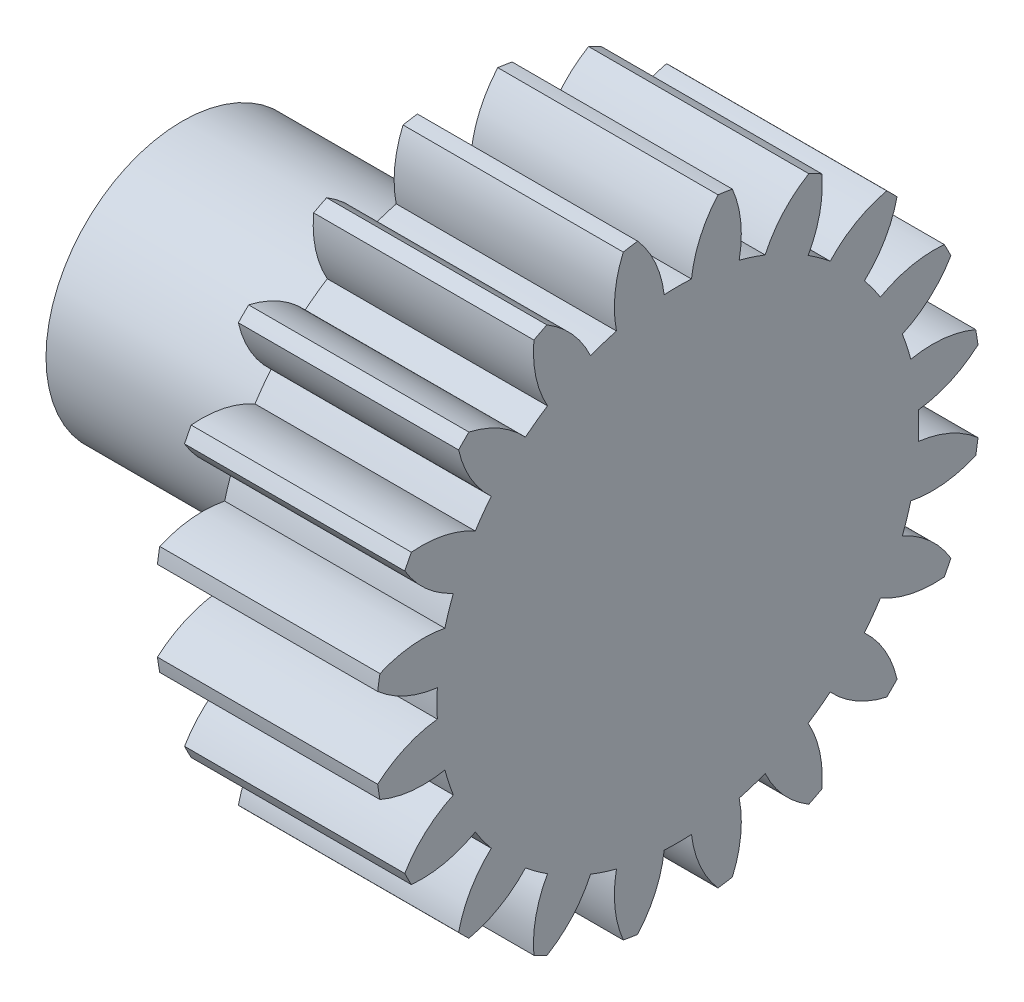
ISO-10303-21;
HEADER;
FILE_DESCRIPTION(('STEP AP214'),'2;1');
FILE_NAME('part.step','',(''),(''),'','','');
FILE_SCHEMA(('AUTOMOTIVE_DESIGN { 1 0 10303 214 1 1 1 1 }'));
ENDSEC;
DATA;
#1=APPLICATION_CONTEXT('core data for automotive mechanical design processes');
#2=APPLICATION_PROTOCOL_DEFINITION('international standard','automotive_design',2000,#1);
#3=PRODUCT_CONTEXT('',#1,'mechanical');
#4=PRODUCT('Part','Part','',(#3));
#5=PRODUCT_RELATED_PRODUCT_CATEGORY('part','',(#4));
#6=PRODUCT_DEFINITION_FORMATION('','',#4);
#7=PRODUCT_DEFINITION_CONTEXT('part definition',#1,'design');
#8=PRODUCT_DEFINITION('design','',#6,#7);
#9=PRODUCT_DEFINITION_SHAPE('','',#8);
#10=(LENGTH_UNIT() NAMED_UNIT(*) SI_UNIT(.MILLI.,.METRE.));
#11=(NAMED_UNIT(*) PLANE_ANGLE_UNIT() SI_UNIT($,.RADIAN.));
#12=(NAMED_UNIT(*) SI_UNIT($,.STERADIAN.) SOLID_ANGLE_UNIT());
#13=UNCERTAINTY_MEASURE_WITH_UNIT(LENGTH_MEASURE(1.E-05),#10,'distance_accuracy_value','');
#14=(GEOMETRIC_REPRESENTATION_CONTEXT(3) GLOBAL_UNCERTAINTY_ASSIGNED_CONTEXT((#13)) GLOBAL_UNIT_ASSIGNED_CONTEXT((#10,
#11,#12)) REPRESENTATION_CONTEXT('',''));
#15=CARTESIAN_POINT('',(0.,0.,0.));
#16=DIRECTION('',(0.,0.,1.));
#17=DIRECTION('',(1.,0.,0.));
#18=AXIS2_PLACEMENT_3D('',#15,#16,#17);
#19=CARTESIAN_POINT('',(16.,0.,0.));
#20=DIRECTION('',(-1.,0.,0.));
#21=DIRECTION('',(0.,0.,1.));
#22=AXIS2_PLACEMENT_3D('',#19,#20,#21);
#23=PLANE('',#22);
#24=CARTESIAN_POINT('',(16.,6.70132317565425,12.4004946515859));
#25=DIRECTION('',(-1.,0.,0.));
#26=DIRECTION('',(0.,1.,0.));
#27=AXIS2_PLACEMENT_3D('',#24,#25,#26);
#28=CIRCLE('',#27,6.);
#29=CARTESIAN_POINT('',(16.,0.742635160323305,13.1033724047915));
#30=VERTEX_POINT('',#29);
#31=CARTESIAN_POINT('',(16.,2.18825272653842,16.354251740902));
#32=VERTEX_POINT('',#31);
#33=EDGE_CURVE('E570',#30,#32,#28,.T.);
#34=ORIENTED_EDGE('',*,*,#33,.F.);
#35=CARTESIAN_POINT('',(16.,0.,0.));
#36=DIRECTION('',(-1.,0.,0.));
#37=DIRECTION('',(0.,1.,0.));
#38=AXIS2_PLACEMENT_3D('',#35,#36,#37);
#39=CIRCLE('',#38,13.1244);
#40=CARTESIAN_POINT('',(16.,-0.742635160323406,13.1033724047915));
#41=VERTEX_POINT('',#40);
#42=EDGE_CURVE('E575',#41,#30,#39,.T.);
#43=ORIENTED_EDGE('',*,*,#42,.F.);
#44=CARTESIAN_POINT('',(16.,-6.70132317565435,12.4004946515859));
#45=DIRECTION('',(-1.,0.,0.));
#46=DIRECTION('',(0.,1.,0.));
#47=AXIS2_PLACEMENT_3D('',#44,#45,#46);
#48=CIRCLE('',#47,6.);
#49=CARTESIAN_POINT('',(16.,-2.18825272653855,16.354251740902));
#50=VERTEX_POINT('',#49);
#51=EDGE_CURVE('E572',#50,#41,#48,.T.);
#52=ORIENTED_EDGE('',*,*,#51,.F.);
#53=CARTESIAN_POINT('',(16.,0.,0.));
#54=DIRECTION('',(-1.,0.,0.));
#55=DIRECTION('',(0.,0.,1.));
#56=AXIS2_PLACEMENT_3D('',#53,#54,#55);
#57=CIRCLE('',#56,16.5);
#58=CARTESIAN_POINT('',(16.,-2.97258970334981,16.2300249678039));
#59=VERTEX_POINT('',#58);
#60=EDGE_CURVE('E1037',#59,#50,#57,.T.);
#61=ORIENTED_EDGE('',*,*,#60,.F.);
#62=CARTESIAN_POINT('',(16.,2.54137348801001,13.8643939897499));
#63=DIRECTION('',(-1.,0.,0.));
#64=DIRECTION('',(0.,0.951056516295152,0.309016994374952));
#65=AXIS2_PLACEMENT_3D('',#62,#63,#64);
#66=CIRCLE('',#65,6.);
#67=CARTESIAN_POINT('',(16.,-3.34287674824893,12.6915345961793));
#68=VERTEX_POINT('',#67);
#69=EDGE_CURVE('E688',#68,#59,#66,.T.);
#70=ORIENTED_EDGE('',*,*,#69,.F.);
#71=CARTESIAN_POINT('',(16.,0.,0.));
#72=DIRECTION('',(-1.,0.,0.));
#73=DIRECTION('',(0.,0.951056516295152,0.309016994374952));
#74=AXIS2_PLACEMENT_3D('',#71,#72,#73);
#75=CIRCLE('',#74,13.1244);
#76=CARTESIAN_POINT('',(16.,-4.75545276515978,12.2325608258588));
#77=VERTEX_POINT('',#76);
#78=EDGE_CURVE('E693',#77,#68,#75,.T.);
#79=ORIENTED_EDGE('',*,*,#78,.F.);
#80=CARTESIAN_POINT('',(16.,-10.2053006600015,9.72274849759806));
#81=DIRECTION('',(-1.,0.,0.));
#82=DIRECTION('',(0.,0.951056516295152,0.309016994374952));
#83=AXIS2_PLACEMENT_3D('',#80,#81,#82);
#84=CIRCLE('',#83,6.);
#85=CARTESIAN_POINT('',(16.,-7.13489373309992,14.8776104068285));
#86=VERTEX_POINT('',#85);
#87=EDGE_CURVE('E690',#86,#77,#84,.T.);
#88=ORIENTED_EDGE('',*,*,#87,.F.);
#89=CARTESIAN_POINT('',(16.,-7.84245434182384,14.5170902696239));
#90=VERTEX_POINT('',#89);
#91=EDGE_CURVE('E1131',#90,#86,#57,.T.);
#92=ORIENTED_EDGE('',*,*,#91,.F.);
#93=CARTESIAN_POINT('',(16.,-1.86734354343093,13.971149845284));
#94=DIRECTION('',(-1.,0.,0.));
#95=DIRECTION('',(0.,0.809016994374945,0.587785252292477));
#96=AXIS2_PLACEMENT_3D('',#93,#94,#95);
#97=CIRCLE('',#96,6.);
#98=CARTESIAN_POINT('',(16.,-7.1011645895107,11.0373609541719));
#99=VERTEX_POINT('',#98);
#100=EDGE_CURVE('E671',#99,#90,#97,.T.);
#101=ORIENTED_EDGE('',*,*,#100,.F.);
#102=CARTESIAN_POINT('',(16.,0.,0.));
#103=DIRECTION('',(-1.,0.,0.));
#104=DIRECTION('',(0.,0.809016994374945,0.587785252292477));
#105=AXIS2_PLACEMENT_3D('',#102,#103,#104);
#106=CIRCLE('',#105,13.1244);
#107=CARTESIAN_POINT('',(16.,-8.30277352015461,10.1643409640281));
#108=VERTEX_POINT('',#107);
#109=EDGE_CURVE('E676',#108,#99,#106,.T.);
#110=ORIENTED_EDGE('',*,*,#109,.F.);
#111=CARTESIAN_POINT('',(16.,-12.7103122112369,6.09327197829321));
#112=DIRECTION('',(-1.,0.,0.));
#113=DIRECTION('',(0.,0.809016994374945,0.587785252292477));
#114=AXIS2_PLACEMENT_3D('',#111,#112,#113);
#115=CIRCLE('',#114,6.);
#116=CARTESIAN_POINT('',(16.,-11.3831216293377,11.9446449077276));
#117=VERTEX_POINT('',#116);
#118=EDGE_CURVE('E673',#117,#108,#115,.T.);
#119=ORIENTED_EDGE('',*,*,#118,.F.);
#120=CARTESIAN_POINT('',(16.,-11.9446449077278,11.3831216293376));
#121=VERTEX_POINT('',#120);
#122=EDGE_CURVE('E1109',#121,#117,#57,.T.);
#123=ORIENTED_EDGE('',*,*,#122,.F.);
#124=CARTESIAN_POINT('',(16.,-6.09327197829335,12.7103122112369));
#125=DIRECTION('',(-1.,0.,0.));
#126=DIRECTION('',(0.,0.587785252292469,0.809016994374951));
#127=AXIS2_PLACEMENT_3D('',#124,#125,#126);
#128=CIRCLE('',#127,6.);
#129=CARTESIAN_POINT('',(16.,-10.1643409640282,8.30277352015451));
#130=VERTEX_POINT('',#129);
#131=EDGE_CURVE('E654',#130,#121,#128,.T.);
#132=ORIENTED_EDGE('',*,*,#131,.F.);
#133=CARTESIAN_POINT('',(16.,0.,0.));
#134=DIRECTION('',(-1.,0.,0.));
#135=DIRECTION('',(0.,0.587785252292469,0.809016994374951));
#136=AXIS2_PLACEMENT_3D('',#133,#134,#135);
#137=CIRCLE('',#136,13.1244);
#138=CARTESIAN_POINT('',(16.,-11.037360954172,7.10116458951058));
#139=VERTEX_POINT('',#138);
#140=EDGE_CURVE('E659',#139,#130,#137,.T.);
#141=ORIENTED_EDGE('',*,*,#140,.F.);
#142=CARTESIAN_POINT('',(16.,-13.971149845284,1.86734354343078));
#143=DIRECTION('',(-1.,0.,0.));
#144=DIRECTION('',(0.,0.587785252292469,0.809016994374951));
#145=AXIS2_PLACEMENT_3D('',#142,#143,#144);
#146=CIRCLE('',#145,6.);
#147=CARTESIAN_POINT('',(16.,-14.517090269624,7.84245434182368));
#148=VERTEX_POINT('',#147);
#149=EDGE_CURVE('E656',#148,#139,#146,.T.);
#150=ORIENTED_EDGE('',*,*,#149,.F.);
#151=CARTESIAN_POINT('',(16.,-14.8776104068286,7.13489373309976));
#152=VERTEX_POINT('',#151);
#153=EDGE_CURVE('E1222',#152,#148,#57,.T.);
#154=ORIENTED_EDGE('',*,*,#153,.F.);
#155=CARTESIAN_POINT('',(16.,-9.72274849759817,10.2053006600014));
#156=DIRECTION('',(-1.,0.,0.));
#157=DIRECTION('',(0.,0.309016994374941,0.951056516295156));
#158=AXIS2_PLACEMENT_3D('',#155,#156,#157);
#159=CIRCLE('',#158,6.);
#160=CARTESIAN_POINT('',(16.,-12.2325608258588,4.75545276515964));
#161=VERTEX_POINT('',#160);
#162=EDGE_CURVE('E618',#161,#152,#159,.T.);
#163=ORIENTED_EDGE('',*,*,#162,.F.);
#164=CARTESIAN_POINT('',(16.,0.,0.));
#165=DIRECTION('',(-1.,0.,0.));
#166=DIRECTION('',(0.,0.309016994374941,0.951056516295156));
#167=AXIS2_PLACEMENT_3D('',#164,#165,#166);
#168=CIRCLE('',#167,13.1244);
#169=CARTESIAN_POINT('',(16.,-12.6915345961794,3.34287674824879));
#170=VERTEX_POINT('',#169);
#171=EDGE_CURVE('E623',#170,#161,#168,.T.);
#172=ORIENTED_EDGE('',*,*,#171,.F.);
#173=CARTESIAN_POINT('',(16.,-13.8643939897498,-2.54137348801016));
#174=DIRECTION('',(-1.,0.,0.));
#175=DIRECTION('',(0.,0.309016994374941,0.951056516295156));
#176=AXIS2_PLACEMENT_3D('',#173,#174,#175);
#177=CIRCLE('',#176,6.);
#178=CARTESIAN_POINT('',(16.,-16.230024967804,2.97258970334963));
#179=VERTEX_POINT('',#178);
#180=EDGE_CURVE('E620',#179,#170,#177,.T.);
#181=ORIENTED_EDGE('',*,*,#180,.F.);
#182=CARTESIAN_POINT('',(16.,-16.354251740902,2.18825272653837));
#183=VERTEX_POINT('',#182);
#184=EDGE_CURVE('E1216',#183,#179,#57,.T.);
#185=ORIENTED_EDGE('',*,*,#184,.F.);
#186=CARTESIAN_POINT('',(16.,-12.4004946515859,6.70132317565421));
#187=DIRECTION('',(-1.,0.,0.));
#188=DIRECTION('',(0.,0.,1.));
#189=AXIS2_PLACEMENT_3D('',#186,#187,#188);
#190=CIRCLE('',#189,6.);
#191=CARTESIAN_POINT('',(16.,-13.1033724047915,0.742635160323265));
#192=VERTEX_POINT('',#191);
#193=EDGE_CURVE('E637',#192,#183,#190,.T.);
#194=ORIENTED_EDGE('',*,*,#193,.F.);
#195=CARTESIAN_POINT('',(16.,0.,0.));
#196=DIRECTION('',(-1.,0.,0.));
#197=DIRECTION('',(0.,0.,1.));
#198=AXIS2_PLACEMENT_3D('',#195,#196,#197);
#199=CIRCLE('',#198,13.1244);
#200=CARTESIAN_POINT('',(16.,-13.1033724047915,-0.742635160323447));
#201=VERTEX_POINT('',#200);
#202=EDGE_CURVE('E642',#201,#192,#199,.T.);
#203=ORIENTED_EDGE('',*,*,#202,.F.);
#204=CARTESIAN_POINT('',(16.,-12.4004946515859,-6.70132317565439));
#205=DIRECTION('',(-1.,0.,0.));
#206=DIRECTION('',(0.,0.,1.));
#207=AXIS2_PLACEMENT_3D('',#204,#205,#206);
#208=CIRCLE('',#207,6.);
#209=CARTESIAN_POINT('',(16.,-16.354251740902,-2.1882527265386));
#210=VERTEX_POINT('',#209);
#211=EDGE_CURVE('E639',#210,#201,#208,.T.);
#212=ORIENTED_EDGE('',*,*,#211,.F.);
#213=CARTESIAN_POINT('',(16.,-16.2300249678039,-2.97258970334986));
#214=VERTEX_POINT('',#213);
#215=EDGE_CURVE('E1210',#214,#210,#57,.T.);
#216=ORIENTED_EDGE('',*,*,#215,.F.);
#217=CARTESIAN_POINT('',(16.,-13.8643939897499,2.54137348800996));
#218=DIRECTION('',(-1.,0.,0.));
#219=DIRECTION('',(0.,-0.309016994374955,0.951056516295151));
#220=AXIS2_PLACEMENT_3D('',#217,#218,#219);
#221=CIRCLE('',#220,6.);
#222=CARTESIAN_POINT('',(16.,-12.6915345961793,-3.34287674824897));
#223=VERTEX_POINT('',#222);
#224=EDGE_CURVE('E756',#223,#214,#221,.T.);
#225=ORIENTED_EDGE('',*,*,#224,.F.);
#226=CARTESIAN_POINT('',(16.,0.,0.));
#227=DIRECTION('',(-1.,0.,0.));
#228=DIRECTION('',(0.,-0.309016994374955,0.951056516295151));
#229=AXIS2_PLACEMENT_3D('',#226,#227,#228);
#230=CIRCLE('',#229,13.1244);
#231=CARTESIAN_POINT('',(16.,-12.2325608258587,-4.75545276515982));
#232=VERTEX_POINT('',#231);
#233=EDGE_CURVE('E761',#232,#223,#230,.T.);
#234=ORIENTED_EDGE('',*,*,#233,.F.);
#235=CARTESIAN_POINT('',(16.,-9.72274849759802,-10.2053006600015));
#236=DIRECTION('',(-1.,0.,0.));
#237=DIRECTION('',(0.,-0.309016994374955,0.951056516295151));
#238=AXIS2_PLACEMENT_3D('',#235,#236,#237);
#239=CIRCLE('',#238,6.);
#240=CARTESIAN_POINT('',(16.,-14.8776104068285,-7.13489373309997));
#241=VERTEX_POINT('',#240);
#242=EDGE_CURVE('E758',#241,#232,#239,.T.);
#243=ORIENTED_EDGE('',*,*,#242,.F.);
#244=CARTESIAN_POINT('',(16.,-14.5170902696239,-7.84245434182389));
#245=VERTEX_POINT('',#244);
#246=EDGE_CURVE('E1204',#245,#241,#57,.T.);
#247=ORIENTED_EDGE('',*,*,#246,.F.);
#248=CARTESIAN_POINT('',(16.,-13.971149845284,-1.86734354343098));
#249=DIRECTION('',(-1.,0.,0.));
#250=DIRECTION('',(0.,-0.58778525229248,0.809016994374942));
#251=AXIS2_PLACEMENT_3D('',#248,#249,#250);
#252=CIRCLE('',#251,6.);
#253=CARTESIAN_POINT('',(16.,-11.0373609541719,-7.10116458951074));
#254=VERTEX_POINT('',#253);
#255=EDGE_CURVE('E739',#254,#245,#252,.T.);
#256=ORIENTED_EDGE('',*,*,#255,.F.);
#257=CARTESIAN_POINT('',(16.,0.,0.));
#258=DIRECTION('',(-1.,0.,0.));
#259=DIRECTION('',(0.,-0.58778525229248,0.809016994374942));
#260=AXIS2_PLACEMENT_3D('',#257,#258,#259);
#261=CIRCLE('',#260,13.1244);
#262=CARTESIAN_POINT('',(16.,-10.1643409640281,-8.30277352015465));
#263=VERTEX_POINT('',#262);
#264=EDGE_CURVE('E744',#263,#254,#261,.T.);
#265=ORIENTED_EDGE('',*,*,#264,.F.);
#266=CARTESIAN_POINT('',(16.,-6.09327197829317,-12.710312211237));
#267=DIRECTION('',(-1.,0.,0.));
#268=DIRECTION('',(0.,-0.58778525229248,0.809016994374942));
#269=AXIS2_PLACEMENT_3D('',#266,#267,#268);
#270=CIRCLE('',#269,6.);
#271=CARTESIAN_POINT('',(16.,-11.9446449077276,-11.3831216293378));
#272=VERTEX_POINT('',#271);
#273=EDGE_CURVE('E741',#272,#263,#270,.T.);
#274=ORIENTED_EDGE('',*,*,#273,.F.);
#275=CARTESIAN_POINT('',(16.,-11.3831216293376,-11.9446449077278));
#276=VERTEX_POINT('',#275);
#277=EDGE_CURVE('E1198',#276,#272,#57,.T.);
#278=ORIENTED_EDGE('',*,*,#277,.F.);
#279=CARTESIAN_POINT('',(16.,-12.7103122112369,-6.0932719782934));
#280=DIRECTION('',(-1.,0.,0.));
#281=DIRECTION('',(0.,-0.809016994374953,0.587785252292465));
#282=AXIS2_PLACEMENT_3D('',#279,#280,#281);
#283=CIRCLE('',#282,6.);
#284=CARTESIAN_POINT('',(16.,-8.30277352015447,-10.1643409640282));
#285=VERTEX_POINT('',#284);
#286=EDGE_CURVE('E722',#285,#276,#283,.T.);
#287=ORIENTED_EDGE('',*,*,#286,.F.);
#288=CARTESIAN_POINT('',(16.,0.,0.));
#289=DIRECTION('',(-1.,0.,0.));
#290=DIRECTION('',(0.,-0.809016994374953,0.587785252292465));
#291=AXIS2_PLACEMENT_3D('',#288,#289,#290);
#292=CIRCLE('',#291,13.1244);
#293=CARTESIAN_POINT('',(16.,-7.10116458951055,-11.037360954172));
#294=VERTEX_POINT('',#293);
#295=EDGE_CURVE('E727',#294,#285,#292,.T.);
#296=ORIENTED_EDGE('',*,*,#295,.F.);
#297=CARTESIAN_POINT('',(16.,-1.86734354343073,-13.971149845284));
#298=DIRECTION('',(-1.,0.,0.));
#299=DIRECTION('',(0.,-0.809016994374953,0.587785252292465));
#300=AXIS2_PLACEMENT_3D('',#297,#298,#299);
#301=CIRCLE('',#300,6.);
#302=CARTESIAN_POINT('',(16.,-7.84245434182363,-14.517090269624));
#303=VERTEX_POINT('',#302);
#304=EDGE_CURVE('E724',#303,#294,#301,.T.);
#305=ORIENTED_EDGE('',*,*,#304,.F.);
#306=CARTESIAN_POINT('',(16.,-7.13489373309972,-14.8776104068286));
#307=VERTEX_POINT('',#306);
#308=EDGE_CURVE('E1192',#307,#303,#57,.T.);
#309=ORIENTED_EDGE('',*,*,#308,.F.);
#310=CARTESIAN_POINT('',(16.,-10.2053006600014,-9.72274849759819));
#311=DIRECTION('',(-1.,0.,0.));
#312=DIRECTION('',(0.,-0.951056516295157,0.309016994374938));
#313=AXIS2_PLACEMENT_3D('',#310,#311,#312);
#314=CIRCLE('',#313,6.);
#315=CARTESIAN_POINT('',(16.,-4.75545276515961,-12.2325608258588));
#316=VERTEX_POINT('',#315);
#317=EDGE_CURVE('E703',#316,#307,#314,.T.);
#318=ORIENTED_EDGE('',*,*,#317,.F.);
#319=CARTESIAN_POINT('',(16.,0.,0.));
#320=DIRECTION('',(-1.,0.,0.));
#321=DIRECTION('',(0.,-0.951056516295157,0.309016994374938));
#322=AXIS2_PLACEMENT_3D('',#319,#320,#321);
#323=CIRCLE('',#322,13.1244);
#324=CARTESIAN_POINT('',(16.,-3.34287674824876,-12.6915345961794));
#325=VERTEX_POINT('',#324);
#326=EDGE_CURVE('E708',#325,#316,#323,.T.);
#327=ORIENTED_EDGE('',*,*,#326,.F.);
#328=CARTESIAN_POINT('',(16.,2.5413734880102,-13.8643939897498));
#329=DIRECTION('',(-1.,0.,0.));
#330=DIRECTION('',(0.,-0.951056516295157,0.309016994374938));
#331=AXIS2_PLACEMENT_3D('',#328,#329,#330);
#332=CIRCLE('',#331,6.);
#333=CARTESIAN_POINT('',(16.,-2.97258970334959,-16.230024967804));
#334=VERTEX_POINT('',#333);
#335=EDGE_CURVE('E705',#334,#325,#332,.T.);
#336=ORIENTED_EDGE('',*,*,#335,.F.);
#337=CARTESIAN_POINT('',(16.,-2.18825272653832,-16.354251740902));
#338=VERTEX_POINT('',#337);
#339=EDGE_CURVE('E1186',#338,#334,#57,.T.);
#340=ORIENTED_EDGE('',*,*,#339,.F.);
#341=CARTESIAN_POINT('',(16.,-6.70132317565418,-12.400494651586));
#342=DIRECTION('',(-1.,0.,0.));
#343=DIRECTION('',(0.,-1.,0.));
#344=AXIS2_PLACEMENT_3D('',#341,#342,#343);
#345=CIRCLE('',#344,6.);
#346=CARTESIAN_POINT('',(16.,-0.742635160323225,-13.1033724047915));
#347=VERTEX_POINT('',#346);
#348=EDGE_CURVE('E824',#347,#338,#345,.T.);
#349=ORIENTED_EDGE('',*,*,#348,.F.);
#350=CARTESIAN_POINT('',(16.,0.,0.));
#351=DIRECTION('',(-1.,0.,0.));
#352=DIRECTION('',(0.,-1.,0.));
#353=AXIS2_PLACEMENT_3D('',#350,#351,#352);
#354=CIRCLE('',#353,13.1244);
#355=CARTESIAN_POINT('',(16.,0.742635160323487,-13.1033724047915));
#356=VERTEX_POINT('',#355);
#357=EDGE_CURVE('E829',#356,#347,#354,.T.);
#358=ORIENTED_EDGE('',*,*,#357,.F.);
#359=CARTESIAN_POINT('',(16.,6.70132317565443,-12.4004946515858));
#360=DIRECTION('',(-1.,0.,0.));
#361=DIRECTION('',(0.,-1.,0.));
#362=AXIS2_PLACEMENT_3D('',#359,#360,#361);
#363=CIRCLE('',#362,6.);
#364=CARTESIAN_POINT('',(16.,2.18825272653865,-16.354251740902));
#365=VERTEX_POINT('',#364);
#366=EDGE_CURVE('E826',#365,#356,#363,.T.);
#367=ORIENTED_EDGE('',*,*,#366,.F.);
#368=CARTESIAN_POINT('',(16.,2.97258970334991,-16.2300249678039));
#369=VERTEX_POINT('',#368);
#370=EDGE_CURVE('E1180',#369,#365,#57,.T.);
#371=ORIENTED_EDGE('',*,*,#370,.F.);
#372=CARTESIAN_POINT('',(16.,-2.54137348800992,-13.8643939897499));
#373=DIRECTION('',(-1.,0.,0.));
#374=DIRECTION('',(0.,-0.95105651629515,-0.309016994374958));
#375=AXIS2_PLACEMENT_3D('',#372,#373,#374);
#376=CIRCLE('',#375,6.);
#377=CARTESIAN_POINT('',(16.,3.34287674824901,-12.6915345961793));
#378=VERTEX_POINT('',#377);
#379=EDGE_CURVE('E841',#378,#369,#376,.T.);
#380=ORIENTED_EDGE('',*,*,#379,.F.);
#381=CARTESIAN_POINT('',(16.,0.,0.));
#382=DIRECTION('',(-1.,0.,0.));
#383=DIRECTION('',(0.,-0.95105651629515,-0.309016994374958));
#384=AXIS2_PLACEMENT_3D('',#381,#382,#383);
#385=CIRCLE('',#384,13.1244);
#386=CARTESIAN_POINT('',(16.,4.75545276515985,-12.2325608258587));
#387=VERTEX_POINT('',#386);
#388=EDGE_CURVE('E846',#387,#378,#385,.T.);
#389=ORIENTED_EDGE('',*,*,#388,.F.);
#390=CARTESIAN_POINT('',(16.,10.2053006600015,-9.72274849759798));
#391=DIRECTION('',(-1.,0.,0.));
#392=DIRECTION('',(0.,-0.95105651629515,-0.309016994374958));
#393=AXIS2_PLACEMENT_3D('',#390,#391,#392);
#394=CIRCLE('',#393,6.);
#395=CARTESIAN_POINT('',(16.,7.13489373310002,-14.8776104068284));
#396=VERTEX_POINT('',#395);
#397=EDGE_CURVE('E843',#396,#387,#394,.T.);
#398=ORIENTED_EDGE('',*,*,#397,.F.);
#399=CARTESIAN_POINT('',(16.,7.84245434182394,-14.5170902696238));
#400=VERTEX_POINT('',#399);
#401=EDGE_CURVE('E1174',#400,#396,#57,.T.);
#402=ORIENTED_EDGE('',*,*,#401,.F.);
#403=CARTESIAN_POINT('',(16.,1.86734354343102,-13.971149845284));
#404=DIRECTION('',(-1.,0.,0.));
#405=DIRECTION('',(0.,-0.80901699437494,-0.587785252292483));
#406=AXIS2_PLACEMENT_3D('',#403,#404,#405);
#407=CIRCLE('',#406,6.);
#408=CARTESIAN_POINT('',(16.,7.10116458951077,-11.0373609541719));
#409=VERTEX_POINT('',#408);
#410=EDGE_CURVE('E807',#409,#400,#407,.T.);
#411=ORIENTED_EDGE('',*,*,#410,.F.);
#412=CARTESIAN_POINT('',(16.,0.,0.));
#413=DIRECTION('',(-1.,0.,0.));
#414=DIRECTION('',(0.,-0.80901699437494,-0.587785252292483));
#415=AXIS2_PLACEMENT_3D('',#412,#413,#414);
#416=CIRCLE('',#415,13.1244);
#417=CARTESIAN_POINT('',(16.,8.30277352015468,-10.164340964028));
#418=VERTEX_POINT('',#417);
#419=EDGE_CURVE('E812',#418,#409,#416,.T.);
#420=ORIENTED_EDGE('',*,*,#419,.F.);
#421=CARTESIAN_POINT('',(16.,12.710312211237,-6.09327197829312));
#422=DIRECTION('',(-1.,0.,0.));
#423=DIRECTION('',(0.,-0.80901699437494,-0.587785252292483));
#424=AXIS2_PLACEMENT_3D('',#421,#422,#423);
#425=CIRCLE('',#424,6.);
#426=CARTESIAN_POINT('',(16.,11.3831216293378,-11.9446449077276));
#427=VERTEX_POINT('',#426);
#428=EDGE_CURVE('E809',#427,#418,#425,.T.);
#429=ORIENTED_EDGE('',*,*,#428,.F.);
#430=CARTESIAN_POINT('',(16.,11.9446449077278,-11.3831216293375));
#431=VERTEX_POINT('',#430);
#432=EDGE_CURVE('E1168',#431,#427,#57,.T.);
#433=ORIENTED_EDGE('',*,*,#432,.F.);
#434=CARTESIAN_POINT('',(16.,6.09327197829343,-12.7103122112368));
#435=DIRECTION('',(-1.,0.,0.));
#436=DIRECTION('',(0.,-0.587785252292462,-0.809016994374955));
#437=AXIS2_PLACEMENT_3D('',#434,#435,#436);
#438=CIRCLE('',#437,6.);
#439=CARTESIAN_POINT('',(16.,10.1643409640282,-8.30277352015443));
#440=VERTEX_POINT('',#439);
#441=EDGE_CURVE('E790',#440,#431,#438,.T.);
#442=ORIENTED_EDGE('',*,*,#441,.F.);
#443=CARTESIAN_POINT('',(16.,0.,0.));
#444=DIRECTION('',(-1.,0.,0.));
#445=DIRECTION('',(0.,-0.587785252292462,-0.809016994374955));
#446=AXIS2_PLACEMENT_3D('',#443,#444,#445);
#447=CIRCLE('',#446,13.1244);
#448=CARTESIAN_POINT('',(16.,11.0373609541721,-7.1011645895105));
#449=VERTEX_POINT('',#448);
#450=EDGE_CURVE('E795',#449,#440,#447,.T.);
#451=ORIENTED_EDGE('',*,*,#450,.F.);
#452=CARTESIAN_POINT('',(16.,13.971149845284,-1.86734354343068));
#453=DIRECTION('',(-1.,0.,0.));
#454=DIRECTION('',(0.,-0.587785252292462,-0.809016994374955));
#455=AXIS2_PLACEMENT_3D('',#452,#453,#454);
#456=CIRCLE('',#455,6.);
#457=CARTESIAN_POINT('',(16.,14.517090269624,-7.84245434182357));
#458=VERTEX_POINT('',#457);
#459=EDGE_CURVE('E792',#458,#449,#456,.T.);
#460=ORIENTED_EDGE('',*,*,#459,.F.);
#461=CARTESIAN_POINT('',(16.,14.8776104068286,-7.13489373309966));
#462=VERTEX_POINT('',#461);
#463=EDGE_CURVE('E981',#462,#458,#57,.T.);
#464=ORIENTED_EDGE('',*,*,#463,.F.);
#465=CARTESIAN_POINT('',(16.,9.72274849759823,-10.2053006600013));
#466=DIRECTION('',(-1.,0.,0.));
#467=DIRECTION('',(0.,-0.309016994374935,-0.951056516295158));
#468=AXIS2_PLACEMENT_3D('',#465,#466,#467);
#469=CIRCLE('',#468,6.);
#470=CARTESIAN_POINT('',(16.,12.2325608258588,-4.75545276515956));
#471=VERTEX_POINT('',#470);
#472=EDGE_CURVE('E771',#471,#462,#469,.T.);
#473=ORIENTED_EDGE('',*,*,#472,.F.);
#474=CARTESIAN_POINT('',(16.,0.,0.));
#475=DIRECTION('',(-1.,0.,0.));
#476=DIRECTION('',(0.,-0.309016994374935,-0.951056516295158));
#477=AXIS2_PLACEMENT_3D('',#474,#475,#476);
#478=CIRCLE('',#477,13.1244);
#479=CARTESIAN_POINT('',(16.,12.6915345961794,-3.34287674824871));
#480=VERTEX_POINT('',#479);
#481=EDGE_CURVE('E776',#480,#471,#478,.T.);
#482=ORIENTED_EDGE('',*,*,#481,.F.);
#483=CARTESIAN_POINT('',(16.,13.8643939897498,2.54137348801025));
#484=DIRECTION('',(-1.,0.,0.));
#485=DIRECTION('',(0.,-0.309016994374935,-0.951056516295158));
#486=AXIS2_PLACEMENT_3D('',#483,#484,#485);
#487=CIRCLE('',#486,6.);
#488=CARTESIAN_POINT('',(16.,16.230024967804,-2.97258970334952));
#489=VERTEX_POINT('',#488);
#490=EDGE_CURVE('E773',#489,#480,#487,.T.);
#491=ORIENTED_EDGE('',*,*,#490,.F.);
#492=CARTESIAN_POINT('',(16.,16.354251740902,-2.18825272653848));
#493=VERTEX_POINT('',#492);
#494=EDGE_CURVE('E977',#493,#489,#57,.T.);
#495=ORIENTED_EDGE('',*,*,#494,.F.);
#496=CARTESIAN_POINT('',(16.,12.4004946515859,-6.7013231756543));
#497=DIRECTION('',(-1.,0.,0.));
#498=DIRECTION('',(0.,0.,-1.));
#499=AXIS2_PLACEMENT_3D('',#496,#497,#498);
#500=CIRCLE('',#499,6.);
#501=CARTESIAN_POINT('',(16.,13.1033724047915,-0.742635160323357));
#502=VERTEX_POINT('',#501);
#503=EDGE_CURVE('E949',#502,#493,#500,.T.);
#504=ORIENTED_EDGE('',*,*,#503,.F.);
#505=CARTESIAN_POINT('',(16.,0.,0.));
#506=DIRECTION('',(-1.,0.,0.));
#507=DIRECTION('',(0.,0.,-1.));
#508=AXIS2_PLACEMENT_3D('',#505,#506,#507);
#509=CIRCLE('',#508,13.1244);
#510=CARTESIAN_POINT('',(16.,13.1033724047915,0.742635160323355));
#511=VERTEX_POINT('',#510);
#512=EDGE_CURVE('E954',#511,#502,#509,.T.);
#513=ORIENTED_EDGE('',*,*,#512,.F.);
#514=CARTESIAN_POINT('',(16.,12.4004946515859,6.7013231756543));
#515=DIRECTION('',(-1.,0.,0.));
#516=DIRECTION('',(0.,0.,-1.));
#517=AXIS2_PLACEMENT_3D('',#514,#515,#516);
#518=CIRCLE('',#517,6.);
#519=CARTESIAN_POINT('',(16.,16.354251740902,2.18825272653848));
#520=VERTEX_POINT('',#519);
#521=EDGE_CURVE('E951',#520,#511,#518,.T.);
#522=ORIENTED_EDGE('',*,*,#521,.F.);
#523=CARTESIAN_POINT('',(16.,16.2300249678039,2.97258970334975));
#524=VERTEX_POINT('',#523);
#525=EDGE_CURVE('E974',#524,#520,#57,.T.);
#526=ORIENTED_EDGE('',*,*,#525,.F.);
#527=CARTESIAN_POINT('',(16.,13.8643939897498,-2.54137348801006));
#528=DIRECTION('',(-1.,0.,0.));
#529=DIRECTION('',(0.,0.309016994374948,-0.951056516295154));
#530=AXIS2_PLACEMENT_3D('',#527,#528,#529);
#531=CIRCLE('',#530,6.);
#532=CARTESIAN_POINT('',(16.,12.6915345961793,3.34287674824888));
#533=VERTEX_POINT('',#532);
#534=EDGE_CURVE('E927',#533,#524,#531,.T.);
#535=ORIENTED_EDGE('',*,*,#534,.F.);
#536=CARTESIAN_POINT('',(16.,0.,0.));
#537=DIRECTION('',(-1.,0.,0.));
#538=DIRECTION('',(0.,0.309016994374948,-0.951056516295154));
#539=AXIS2_PLACEMENT_3D('',#536,#537,#538);
#540=CIRCLE('',#539,13.1244);
#541=CARTESIAN_POINT('',(16.,12.2325608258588,4.75545276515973));
#542=VERTEX_POINT('',#541);
#543=EDGE_CURVE('E932',#542,#533,#540,.T.);
#544=ORIENTED_EDGE('',*,*,#543,.F.);
#545=CARTESIAN_POINT('',(16.,9.72274849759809,10.2053006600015));
#546=DIRECTION('',(-1.,0.,0.));
#547=DIRECTION('',(0.,0.309016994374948,-0.951056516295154));
#548=AXIS2_PLACEMENT_3D('',#545,#546,#547);
#549=CIRCLE('',#548,6.);
#550=CARTESIAN_POINT('',(16.,14.8776104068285,7.13489373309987));
#551=VERTEX_POINT('',#550);
#552=EDGE_CURVE('E929',#551,#542,#549,.T.);
#553=ORIENTED_EDGE('',*,*,#552,.F.);
#554=CARTESIAN_POINT('',(16.,14.5170902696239,7.84245434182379));
#555=VERTEX_POINT('',#554);
#556=EDGE_CURVE('E982',#555,#551,#57,.T.);
#557=ORIENTED_EDGE('',*,*,#556,.F.);
#558=CARTESIAN_POINT('',(16.,13.971149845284,1.86734354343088));
#559=DIRECTION('',(-1.,0.,0.));
#560=DIRECTION('',(0.,0.587785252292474,-0.809016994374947));
#561=AXIS2_PLACEMENT_3D('',#558,#559,#560);
#562=CIRCLE('',#561,6.);
#563=CARTESIAN_POINT('',(16.,11.037360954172,7.10116458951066));
#564=VERTEX_POINT('',#563);
#565=EDGE_CURVE('E601',#564,#555,#562,.T.);
#566=ORIENTED_EDGE('',*,*,#565,.F.);
#567=CARTESIAN_POINT('',(16.,0.,0.));
#568=DIRECTION('',(-1.,0.,0.));
#569=DIRECTION('',(0.,0.587785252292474,-0.809016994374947));
#570=AXIS2_PLACEMENT_3D('',#567,#568,#569);
#571=CIRCLE('',#570,13.1244);
#572=CARTESIAN_POINT('',(16.,10.1643409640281,8.30277352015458));
#573=VERTEX_POINT('',#572);
#574=EDGE_CURVE('E606',#573,#564,#571,.T.);
#575=ORIENTED_EDGE('',*,*,#574,.F.);
#576=CARTESIAN_POINT('',(16.,6.09327197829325,12.7103122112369));
#577=DIRECTION('',(-1.,0.,0.));
#578=DIRECTION('',(0.,0.587785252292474,-0.809016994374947));
#579=AXIS2_PLACEMENT_3D('',#576,#577,#578);
#580=CIRCLE('',#579,6.);
#581=CARTESIAN_POINT('',(16.,11.9446449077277,11.3831216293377));
#582=VERTEX_POINT('',#581);
#583=EDGE_CURVE('E603',#582,#573,#580,.T.);
#584=ORIENTED_EDGE('',*,*,#583,.F.);
#585=CARTESIAN_POINT('',(16.,11.3831216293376,11.9446449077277));
#586=VERTEX_POINT('',#585);
#587=EDGE_CURVE('E1150',#586,#582,#57,.T.);
#588=ORIENTED_EDGE('',*,*,#587,.F.);
#589=CARTESIAN_POINT('',(16.,12.7103122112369,6.0932719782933));
#590=DIRECTION('',(-1.,0.,0.));
#591=DIRECTION('',(0.,0.809016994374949,-0.587785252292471));
#592=AXIS2_PLACEMENT_3D('',#589,#590,#591);
#593=CIRCLE('',#592,6.);
#594=CARTESIAN_POINT('',(16.,8.30277352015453,10.1643409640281));
#595=VERTEX_POINT('',#594);
#596=EDGE_CURVE('E584',#595,#586,#593,.T.);
#597=ORIENTED_EDGE('',*,*,#596,.F.);
#598=CARTESIAN_POINT('',(16.,0.,0.));
#599=DIRECTION('',(-1.,0.,0.));
#600=DIRECTION('',(0.,0.809016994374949,-0.587785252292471));
#601=AXIS2_PLACEMENT_3D('',#598,#599,#600);
#602=CIRCLE('',#601,13.1244);
#603=CARTESIAN_POINT('',(16.,7.10116458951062,11.037360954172));
#604=VERTEX_POINT('',#603);
#605=EDGE_CURVE('E589',#604,#595,#602,.T.);
#606=ORIENTED_EDGE('',*,*,#605,.F.);
#607=CARTESIAN_POINT('',(16.,1.86734354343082,13.971149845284));
#608=DIRECTION('',(-1.,0.,0.));
#609=DIRECTION('',(0.,0.809016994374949,-0.587785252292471));
#610=AXIS2_PLACEMENT_3D('',#607,#608,#609);
#611=CIRCLE('',#610,6.);
#612=CARTESIAN_POINT('',(16.,7.84245434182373,14.5170902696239));
#613=VERTEX_POINT('',#612);
#614=EDGE_CURVE('E586',#613,#604,#611,.T.);
#615=ORIENTED_EDGE('',*,*,#614,.F.);
#616=CARTESIAN_POINT('',(16.,7.13489373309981,14.8776104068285));
#617=VERTEX_POINT('',#616);
#618=EDGE_CURVE('E1146',#617,#613,#57,.T.);
#619=ORIENTED_EDGE('',*,*,#618,.F.);
#620=CARTESIAN_POINT('',(16.,10.2053006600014,9.72274849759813));
#621=DIRECTION('',(-1.,0.,0.));
#622=DIRECTION('',(0.,0.951056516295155,-0.309016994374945));
#623=AXIS2_PLACEMENT_3D('',#620,#621,#622);
#624=CIRCLE('',#623,6.);
#625=CARTESIAN_POINT('',(16.,4.75545276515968,12.2325608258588));
#626=VERTEX_POINT('',#625);
#627=EDGE_CURVE('E550',#626,#617,#624,.T.);
#628=ORIENTED_EDGE('',*,*,#627,.F.);
#629=CARTESIAN_POINT('',(16.,0.,0.));
#630=DIRECTION('',(-1.,0.,0.));
#631=DIRECTION('',(0.,0.951056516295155,-0.309016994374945));
#632=AXIS2_PLACEMENT_3D('',#629,#630,#631);
#633=CIRCLE('',#632,13.1244);
#634=CARTESIAN_POINT('',(16.,3.34287674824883,12.6915345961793));
#635=VERTEX_POINT('',#634);
#636=EDGE_CURVE('E549',#635,#626,#633,.T.);
#637=ORIENTED_EDGE('',*,*,#636,.F.);
#638=CARTESIAN_POINT('',(16.,-2.54137348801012,13.8643939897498));
#639=DIRECTION('',(-1.,0.,0.));
#640=DIRECTION('',(0.,0.951056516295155,-0.309016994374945));
#641=AXIS2_PLACEMENT_3D('',#638,#639,#640);
#642=CIRCLE('',#641,6.);
#643=CARTESIAN_POINT('',(16.,2.97258970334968,16.2300249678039));
#644=VERTEX_POINT('',#643);
#645=EDGE_CURVE('E538',#644,#635,#642,.T.);
#646=ORIENTED_EDGE('',*,*,#645,.F.);
#647=EDGE_CURVE('E1145',#32,#644,#57,.T.);
#648=ORIENTED_EDGE('',*,*,#647,.F.);
#649=EDGE_LOOP('',(#34,#43,#52,#61,#70,#79,#88,#92,#101,#110,#119,#123,#132,#141,#150,#154,#163,
#172,#181,#185,#194,#203,#212,#216,#225,#234,#243,#247,#256,#265,#274,#278,#287,#296,#305,#309,
#318,#327,#336,#340,#349,#358,#367,#371,#380,#389,#398,#402,#411,#420,#429,#433,#442,#451,#460,
#464,#473,#482,#491,#495,#504,#513,#522,#526,#535,#544,#553,#557,#566,#575,#584,#588,#597,#606,
#615,#619,#628,#637,#646,#648));
#650=FACE_BOUND('',#649,.T.);
#651=ADVANCED_FACE('F41',(#650),#23,.F.);
#652=CARTESIAN_POINT('',(-2.,0.,0.));
#653=DIRECTION('',(-1.,0.,0.));
#654=DIRECTION('',(0.,0.,1.));
#655=AXIS2_PLACEMENT_3D('',#652,#653,#654);
#656=CYLINDRICAL_SURFACE('',#655,16.5);
#657=DIRECTION('',(-1.,0.,0.));
#658=VECTOR('',#657,1.);
#659=CARTESIAN_POINT('',(10.,2.18825272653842,16.354251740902));
#660=LINE('',#659,#658);
#661=CARTESIAN_POINT('',(4.,2.18825272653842,16.354251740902));
#662=VERTEX_POINT('',#661);
#663=EDGE_CURVE('E924',#32,#662,#660,.T.);
#664=ORIENTED_EDGE('',*,*,#663,.F.);
#665=ORIENTED_EDGE('',*,*,#647,.T.);
#666=DIRECTION('',(-1.,0.,0.));
#667=VECTOR('',#666,1.);
#668=CARTESIAN_POINT('',(10.,2.97258970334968,16.2300249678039));
#669=LINE('',#668,#667);
#670=CARTESIAN_POINT('',(4.,2.97258970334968,16.2300249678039));
#671=VERTEX_POINT('',#670);
#672=EDGE_CURVE('E544',#671,#644,#669,.F.);
#673=ORIENTED_EDGE('',*,*,#672,.F.);
#674=CARTESIAN_POINT('',(4.,0.,0.));
#675=DIRECTION('',(-1.,0.,0.));
#676=DIRECTION('',(0.,0.,1.));
#677=AXIS2_PLACEMENT_3D('',#674,#675,#676);
#678=CIRCLE('',#677,16.5);
#679=EDGE_CURVE('E1040',#662,#671,#678,.T.);
#680=ORIENTED_EDGE('',*,*,#679,.F.);
#681=EDGE_LOOP('',(#664,#665,#673,#680));
#682=FACE_BOUND('',#681,.T.);
#683=ADVANCED_FACE('F1259',(#682),#656,.T.);
#684=DIRECTION('',(-1.,0.,0.));
#685=VECTOR('',#684,1.);
#686=CARTESIAN_POINT('',(10.,-2.18825272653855,16.354251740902));
#687=LINE('',#686,#685);
#688=CARTESIAN_POINT('',(4.,-2.18825272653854,16.354251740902));
#689=VERTEX_POINT('',#688);
#690=EDGE_CURVE('E922',#689,#50,#687,.F.);
#691=ORIENTED_EDGE('',*,*,#690,.F.);
#692=CARTESIAN_POINT('',(4.,-2.97258970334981,16.2300249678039));
#693=VERTEX_POINT('',#692);
#694=EDGE_CURVE('E1035',#693,#689,#678,.T.);
#695=ORIENTED_EDGE('',*,*,#694,.F.);
#696=DIRECTION('',(-1.,0.,0.));
#697=VECTOR('',#696,1.);
#698=CARTESIAN_POINT('',(10.,-2.97258970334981,16.2300249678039));
#699=LINE('',#698,#697);
#700=EDGE_CURVE('E897',#59,#693,#699,.T.);
#701=ORIENTED_EDGE('',*,*,#700,.F.);
#702=ORIENTED_EDGE('',*,*,#60,.T.);
#703=EDGE_LOOP('',(#691,#695,#701,#702));
#704=FACE_BOUND('',#703,.T.);
#705=ADVANCED_FACE('F1033',(#704),#656,.T.);
#706=DIRECTION('',(-1.,0.,0.));
#707=VECTOR('',#706,1.);
#708=CARTESIAN_POINT('',(10.,7.13489373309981,14.8776104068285));
#709=LINE('',#708,#707);
#710=CARTESIAN_POINT('',(4.,7.13489373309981,14.8776104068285));
#711=VERTEX_POINT('',#710);
#712=EDGE_CURVE('E920',#617,#711,#709,.T.);
#713=ORIENTED_EDGE('',*,*,#712,.F.);
#714=ORIENTED_EDGE('',*,*,#618,.T.);
#715=DIRECTION('',(-1.,0.,0.));
#716=VECTOR('',#715,1.);
#717=CARTESIAN_POINT('',(10.,7.84245434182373,14.5170902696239));
#718=LINE('',#717,#716);
#719=CARTESIAN_POINT('',(4.,7.84245434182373,14.5170902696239));
#720=VERTEX_POINT('',#719);
#721=EDGE_CURVE('E911',#720,#613,#718,.F.);
#722=ORIENTED_EDGE('',*,*,#721,.F.);
#723=EDGE_CURVE('E1044',#711,#720,#678,.T.);
#724=ORIENTED_EDGE('',*,*,#723,.F.);
#725=EDGE_LOOP('',(#713,#714,#722,#724));
#726=FACE_BOUND('',#725,.T.);
#727=ADVANCED_FACE('F1267',(#726),#656,.T.);
#728=DIRECTION('',(-1.,0.,0.));
#729=VECTOR('',#728,1.);
#730=CARTESIAN_POINT('',(10.,14.5170902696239,7.84245434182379));
#731=LINE('',#730,#729);
#732=CARTESIAN_POINT('',(4.,14.5170902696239,7.84245434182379));
#733=VERTEX_POINT('',#732);
#734=EDGE_CURVE('E917',#555,#733,#731,.T.);
#735=ORIENTED_EDGE('',*,*,#734,.F.);
#736=ORIENTED_EDGE('',*,*,#556,.T.);
#737=DIRECTION('',(-1.,0.,0.));
#738=VECTOR('',#737,1.);
#739=CARTESIAN_POINT('',(10.,14.8776104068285,7.13489373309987));
#740=LINE('',#739,#738);
#741=CARTESIAN_POINT('',(4.,14.8776104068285,7.13489373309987));
#742=VERTEX_POINT('',#741);
#743=EDGE_CURVE('E943',#742,#551,#740,.F.);
#744=ORIENTED_EDGE('',*,*,#743,.F.);
#745=EDGE_CURVE('E976',#733,#742,#678,.T.);
#746=ORIENTED_EDGE('',*,*,#745,.F.);
#747=EDGE_LOOP('',(#735,#736,#744,#746));
#748=FACE_BOUND('',#747,.T.);
#749=ADVANCED_FACE('F1422',(#748),#656,.T.);
#750=DIRECTION('',(-1.,0.,0.));
#751=VECTOR('',#750,1.);
#752=CARTESIAN_POINT('',(10.,11.9446449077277,11.3831216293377));
#753=LINE('',#752,#751);
#754=CARTESIAN_POINT('',(4.,11.9446449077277,11.3831216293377));
#755=VERTEX_POINT('',#754);
#756=EDGE_CURVE('E915',#755,#582,#753,.F.);
#757=ORIENTED_EDGE('',*,*,#756,.F.);
#758=CARTESIAN_POINT('',(4.,11.3831216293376,11.9446449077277));
#759=VERTEX_POINT('',#758);
#760=EDGE_CURVE('E1047',#759,#755,#678,.T.);
#761=ORIENTED_EDGE('',*,*,#760,.F.);
#762=DIRECTION('',(-1.,0.,0.));
#763=VECTOR('',#762,1.);
#764=CARTESIAN_POINT('',(10.,11.3831216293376,11.9446449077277));
#765=LINE('',#764,#763);
#766=EDGE_CURVE('E913',#586,#759,#765,.T.);
#767=ORIENTED_EDGE('',*,*,#766,.F.);
#768=ORIENTED_EDGE('',*,*,#587,.T.);
#769=EDGE_LOOP('',(#757,#761,#767,#768));
#770=FACE_BOUND('',#769,.T.);
#771=ADVANCED_FACE('F2130',(#770),#656,.T.);
#772=DIRECTION('',(-1.,0.,0.));
#773=VECTOR('',#772,1.);
#774=CARTESIAN_POINT('',(10.,-11.9446449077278,11.3831216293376));
#775=LINE('',#774,#773);
#776=CARTESIAN_POINT('',(4.,-11.9446449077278,11.3831216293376));
#777=VERTEX_POINT('',#776);
#778=EDGE_CURVE('E909',#121,#777,#775,.T.);
#779=ORIENTED_EDGE('',*,*,#778,.F.);
#780=ORIENTED_EDGE('',*,*,#122,.T.);
#781=DIRECTION('',(-1.,0.,0.));
#782=VECTOR('',#781,1.);
#783=CARTESIAN_POINT('',(10.,-11.3831216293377,11.9446449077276));
#784=LINE('',#783,#782);
#785=CARTESIAN_POINT('',(4.,-11.3831216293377,11.9446449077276));
#786=VERTEX_POINT('',#785);
#787=EDGE_CURVE('E891',#786,#117,#784,.F.);
#788=ORIENTED_EDGE('',*,*,#787,.F.);
#789=EDGE_CURVE('E1042',#777,#786,#678,.T.);
#790=ORIENTED_EDGE('',*,*,#789,.F.);
#791=EDGE_LOOP('',(#779,#780,#788,#790));
#792=FACE_BOUND('',#791,.T.);
#793=ADVANCED_FACE('F1106',(#792),#656,.T.);
#794=DIRECTION('',(-1.,0.,0.));
#795=VECTOR('',#794,1.);
#796=CARTESIAN_POINT('',(10.,-14.517090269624,7.84245434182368));
#797=LINE('',#796,#795);
#798=CARTESIAN_POINT('',(4.,-14.517090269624,7.84245434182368));
#799=VERTEX_POINT('',#798);
#800=EDGE_CURVE('E907',#799,#148,#797,.F.);
#801=ORIENTED_EDGE('',*,*,#800,.F.);
#802=CARTESIAN_POINT('',(4.,-14.8776104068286,7.13489373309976));
#803=VERTEX_POINT('',#802);
#804=EDGE_CURVE('E1094',#803,#799,#678,.T.);
#805=ORIENTED_EDGE('',*,*,#804,.F.);
#806=DIRECTION('',(-1.,0.,0.));
#807=VECTOR('',#806,1.);
#808=CARTESIAN_POINT('',(10.,-14.8776104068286,7.13489373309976));
#809=LINE('',#808,#807);
#810=EDGE_CURVE('E905',#152,#803,#809,.T.);
#811=ORIENTED_EDGE('',*,*,#810,.F.);
#812=ORIENTED_EDGE('',*,*,#153,.T.);
#813=EDGE_LOOP('',(#801,#805,#811,#812));
#814=FACE_BOUND('',#813,.T.);
#815=ADVANCED_FACE('F1232',(#814),#656,.T.);
#816=DIRECTION('',(-1.,0.,0.));
#817=VECTOR('',#816,1.);
#818=CARTESIAN_POINT('',(10.,-16.230024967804,2.97258970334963));
#819=LINE('',#818,#817);
#820=CARTESIAN_POINT('',(4.,-16.230024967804,2.97258970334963));
#821=VERTEX_POINT('',#820);
#822=EDGE_CURVE('E903',#821,#179,#819,.F.);
#823=ORIENTED_EDGE('',*,*,#822,.F.);
#824=CARTESIAN_POINT('',(4.,-16.354251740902,2.18825272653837));
#825=VERTEX_POINT('',#824);
#826=EDGE_CURVE('E1090',#825,#821,#678,.T.);
#827=ORIENTED_EDGE('',*,*,#826,.F.);
#828=DIRECTION('',(-1.,0.,0.));
#829=VECTOR('',#828,1.);
#830=CARTESIAN_POINT('',(10.,-16.354251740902,2.18825272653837));
#831=LINE('',#830,#829);
#832=EDGE_CURVE('E901',#183,#825,#831,.T.);
#833=ORIENTED_EDGE('',*,*,#832,.F.);
#834=ORIENTED_EDGE('',*,*,#184,.T.);
#835=EDGE_LOOP('',(#823,#827,#833,#834));
#836=FACE_BOUND('',#835,.T.);
#837=ADVANCED_FACE('F1366',(#836),#656,.T.);
#838=DIRECTION('',(-1.,0.,0.));
#839=VECTOR('',#838,1.);
#840=CARTESIAN_POINT('',(10.,-16.354251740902,-2.1882527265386));
#841=LINE('',#840,#839);
#842=CARTESIAN_POINT('',(4.,-16.354251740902,-2.1882527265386));
#843=VERTEX_POINT('',#842);
#844=EDGE_CURVE('E899',#843,#210,#841,.F.);
#845=ORIENTED_EDGE('',*,*,#844,.F.);
#846=CARTESIAN_POINT('',(4.,-16.2300249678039,-2.97258970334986));
#847=VERTEX_POINT('',#846);
#848=EDGE_CURVE('E1086',#847,#843,#678,.T.);
#849=ORIENTED_EDGE('',*,*,#848,.F.);
#850=DIRECTION('',(-1.,0.,0.));
#851=VECTOR('',#850,1.);
#852=CARTESIAN_POINT('',(10.,-16.2300249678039,-2.97258970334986));
#853=LINE('',#852,#851);
#854=EDGE_CURVE('E881',#214,#847,#853,.T.);
#855=ORIENTED_EDGE('',*,*,#854,.F.);
#856=ORIENTED_EDGE('',*,*,#215,.T.);
#857=EDGE_LOOP('',(#845,#849,#855,#856));
#858=FACE_BOUND('',#857,.T.);
#859=ADVANCED_FACE('F1353',(#858),#656,.T.);
#860=DIRECTION('',(-1.,0.,0.));
#861=VECTOR('',#860,1.);
#862=CARTESIAN_POINT('',(10.,-7.13489373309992,14.8776104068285));
#863=LINE('',#862,#861);
#864=CARTESIAN_POINT('',(4.,-7.13489373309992,14.8776104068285));
#865=VERTEX_POINT('',#864);
#866=EDGE_CURVE('E895',#865,#86,#863,.F.);
#867=ORIENTED_EDGE('',*,*,#866,.F.);
#868=CARTESIAN_POINT('',(4.,-7.84245434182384,14.5170902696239));
#869=VERTEX_POINT('',#868);
#870=EDGE_CURVE('E1039',#869,#865,#678,.T.);
#871=ORIENTED_EDGE('',*,*,#870,.F.);
#872=DIRECTION('',(-1.,0.,0.));
#873=VECTOR('',#872,1.);
#874=CARTESIAN_POINT('',(10.,-7.84245434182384,14.5170902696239));
#875=LINE('',#874,#873);
#876=EDGE_CURVE('E893',#90,#869,#875,.T.);
#877=ORIENTED_EDGE('',*,*,#876,.F.);
#878=ORIENTED_EDGE('',*,*,#91,.T.);
#879=EDGE_LOOP('',(#867,#871,#877,#878));
#880=FACE_BOUND('',#879,.T.);
#881=ADVANCED_FACE('F1129',(#880),#656,.T.);
#882=DIRECTION('',(-1.,0.,0.));
#883=VECTOR('',#882,1.);
#884=CARTESIAN_POINT('',(10.,-11.3831216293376,-11.9446449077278));
#885=LINE('',#884,#883);
#886=CARTESIAN_POINT('',(4.,-11.3831216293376,-11.9446449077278));
#887=VERTEX_POINT('',#886);
#888=EDGE_CURVE('E889',#276,#887,#885,.T.);
#889=ORIENTED_EDGE('',*,*,#888,.F.);
#890=ORIENTED_EDGE('',*,*,#277,.T.);
#891=DIRECTION('',(-1.,0.,0.));
#892=VECTOR('',#891,1.);
#893=CARTESIAN_POINT('',(10.,-11.9446449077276,-11.3831216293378));
#894=LINE('',#893,#892);
#895=CARTESIAN_POINT('',(4.,-11.9446449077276,-11.3831216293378));
#896=VERTEX_POINT('',#895);
#897=EDGE_CURVE('E875',#896,#272,#894,.F.);
#898=ORIENTED_EDGE('',*,*,#897,.F.);
#899=EDGE_CURVE('E1078',#887,#896,#678,.T.);
#900=ORIENTED_EDGE('',*,*,#899,.F.);
#901=EDGE_LOOP('',(#889,#890,#898,#900));
#902=FACE_BOUND('',#901,.T.);
#903=ADVANCED_FACE('F1327',(#902),#656,.T.);
#904=DIRECTION('',(-1.,0.,0.));
#905=VECTOR('',#904,1.);
#906=CARTESIAN_POINT('',(10.,-7.84245434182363,-14.517090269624));
#907=LINE('',#906,#905);
#908=CARTESIAN_POINT('',(4.,-7.84245434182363,-14.517090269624));
#909=VERTEX_POINT('',#908);
#910=EDGE_CURVE('E887',#909,#303,#907,.F.);
#911=ORIENTED_EDGE('',*,*,#910,.F.);
#912=CARTESIAN_POINT('',(4.,-7.13489373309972,-14.8776104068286));
#913=VERTEX_POINT('',#912);
#914=EDGE_CURVE('E1074',#913,#909,#678,.T.);
#915=ORIENTED_EDGE('',*,*,#914,.F.);
#916=DIRECTION('',(-1.,0.,0.));
#917=VECTOR('',#916,1.);
#918=CARTESIAN_POINT('',(10.,-7.13489373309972,-14.8776104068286));
#919=LINE('',#918,#917);
#920=EDGE_CURVE('E885',#307,#913,#919,.T.);
#921=ORIENTED_EDGE('',*,*,#920,.F.);
#922=ORIENTED_EDGE('',*,*,#308,.T.);
#923=EDGE_LOOP('',(#911,#915,#921,#922));
#924=FACE_BOUND('',#923,.T.);
#925=ADVANCED_FACE('F1314',(#924),#656,.T.);
#926=DIRECTION('',(-1.,0.,0.));
#927=VECTOR('',#926,1.);
#928=CARTESIAN_POINT('',(10.,-2.97258970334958,-16.230024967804));
#929=LINE('',#928,#927);
#930=CARTESIAN_POINT('',(4.,-2.97258970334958,-16.230024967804));
#931=VERTEX_POINT('',#930);
#932=EDGE_CURVE('E883',#931,#334,#929,.F.);
#933=ORIENTED_EDGE('',*,*,#932,.F.);
#934=CARTESIAN_POINT('',(4.,-2.18825272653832,-16.354251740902));
#935=VERTEX_POINT('',#934);
#936=EDGE_CURVE('E1070',#935,#931,#678,.T.);
#937=ORIENTED_EDGE('',*,*,#936,.F.);
#938=DIRECTION('',(-1.,0.,0.));
#939=VECTOR('',#938,1.);
#940=CARTESIAN_POINT('',(10.,-2.18825272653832,-16.354251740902));
#941=LINE('',#940,#939);
#942=EDGE_CURVE('E857',#338,#935,#941,.T.);
#943=ORIENTED_EDGE('',*,*,#942,.F.);
#944=ORIENTED_EDGE('',*,*,#339,.T.);
#945=EDGE_LOOP('',(#933,#937,#943,#944));
#946=FACE_BOUND('',#945,.T.);
#947=ADVANCED_FACE('F1301',(#946),#656,.T.);
#948=DIRECTION('',(-1.,0.,0.));
#949=VECTOR('',#948,1.);
#950=CARTESIAN_POINT('',(10.,-14.8776104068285,-7.13489373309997));
#951=LINE('',#950,#949);
#952=CARTESIAN_POINT('',(4.,-14.8776104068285,-7.13489373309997));
#953=VERTEX_POINT('',#952);
#954=EDGE_CURVE('E879',#953,#241,#951,.F.);
#955=ORIENTED_EDGE('',*,*,#954,.F.);
#956=CARTESIAN_POINT('',(4.,-14.5170902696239,-7.84245434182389));
#957=VERTEX_POINT('',#956);
#958=EDGE_CURVE('E1082',#957,#953,#678,.T.);
#959=ORIENTED_EDGE('',*,*,#958,.F.);
#960=DIRECTION('',(-1.,0.,0.));
#961=VECTOR('',#960,1.);
#962=CARTESIAN_POINT('',(10.,-14.5170902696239,-7.84245434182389));
#963=LINE('',#962,#961);
#964=EDGE_CURVE('E877',#245,#957,#963,.T.);
#965=ORIENTED_EDGE('',*,*,#964,.F.);
#966=ORIENTED_EDGE('',*,*,#246,.T.);
#967=EDGE_LOOP('',(#955,#959,#965,#966));
#968=FACE_BOUND('',#967,.T.);
#969=ADVANCED_FACE('F1340',(#968),#656,.T.);
#970=DIRECTION('',(-1.,0.,0.));
#971=VECTOR('',#970,1.);
#972=CARTESIAN_POINT('',(10.,7.84245434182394,-14.5170902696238));
#973=LINE('',#972,#971);
#974=CARTESIAN_POINT('',(4.,7.84245434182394,-14.5170902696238));
#975=VERTEX_POINT('',#974);
#976=EDGE_CURVE('E873',#400,#975,#973,.T.);
#977=ORIENTED_EDGE('',*,*,#976,.F.);
#978=ORIENTED_EDGE('',*,*,#401,.T.);
#979=DIRECTION('',(-1.,0.,0.));
#980=VECTOR('',#979,1.);
#981=CARTESIAN_POINT('',(10.,7.13489373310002,-14.8776104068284));
#982=LINE('',#981,#980);
#983=CARTESIAN_POINT('',(4.,7.13489373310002,-14.8776104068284));
#984=VERTEX_POINT('',#983);
#985=EDGE_CURVE('E859',#984,#396,#982,.F.);
#986=ORIENTED_EDGE('',*,*,#985,.F.);
#987=EDGE_CURVE('E1062',#975,#984,#678,.T.);
#988=ORIENTED_EDGE('',*,*,#987,.F.);
#989=EDGE_LOOP('',(#977,#978,#986,#988));
#990=FACE_BOUND('',#989,.T.);
#991=ADVANCED_FACE('F1486',(#990),#656,.T.);
#992=DIRECTION('',(-1.,0.,0.));
#993=VECTOR('',#992,1.);
#994=CARTESIAN_POINT('',(10.,11.3831216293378,-11.9446449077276));
#995=LINE('',#994,#993);
#996=CARTESIAN_POINT('',(4.,11.3831216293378,-11.9446449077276));
#997=VERTEX_POINT('',#996);
#998=EDGE_CURVE('E871',#997,#427,#995,.F.);
#999=ORIENTED_EDGE('',*,*,#998,.F.);
#1000=CARTESIAN_POINT('',(4.,11.9446449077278,-11.3831216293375));
#1001=VERTEX_POINT('',#1000);
#1002=EDGE_CURVE('E1058',#1001,#997,#678,.T.);
#1003=ORIENTED_EDGE('',*,*,#1002,.F.);
#1004=DIRECTION('',(-1.,0.,0.));
#1005=VECTOR('',#1004,1.);
#1006=CARTESIAN_POINT('',(10.,11.9446449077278,-11.3831216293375));
#1007=LINE('',#1006,#1005);
#1008=EDGE_CURVE('E865',#431,#1001,#1007,.T.);
#1009=ORIENTED_EDGE('',*,*,#1008,.F.);
#1010=ORIENTED_EDGE('',*,*,#432,.T.);
#1011=EDGE_LOOP('',(#999,#1003,#1009,#1010));
#1012=FACE_BOUND('',#1011,.T.);
#1013=ADVANCED_FACE('F1473',(#1012),#656,.T.);
#1014=DIRECTION('',(-1.,0.,0.));
#1015=VECTOR('',#1014,1.);
#1016=CARTESIAN_POINT('',(10.,14.8776104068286,-7.13489373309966));
#1017=LINE('',#1016,#1015);
#1018=CARTESIAN_POINT('',(4.,14.8776104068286,-7.13489373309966));
#1019=VERTEX_POINT('',#1018);
#1020=EDGE_CURVE('E869',#462,#1019,#1017,.T.);
#1021=ORIENTED_EDGE('',*,*,#1020,.F.);
#1022=ORIENTED_EDGE('',*,*,#463,.T.);
#1023=DIRECTION('',(-1.,0.,0.));
#1024=VECTOR('',#1023,1.);
#1025=CARTESIAN_POINT('',(10.,14.517090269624,-7.84245434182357));
#1026=LINE('',#1025,#1024);
#1027=CARTESIAN_POINT('',(4.,14.517090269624,-7.84245434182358));
#1028=VERTEX_POINT('',#1027);
#1029=EDGE_CURVE('E863',#1028,#458,#1026,.F.);
#1030=ORIENTED_EDGE('',*,*,#1029,.F.);
#1031=EDGE_CURVE('E975',#1019,#1028,#678,.T.);
#1032=ORIENTED_EDGE('',*,*,#1031,.F.);
#1033=EDGE_LOOP('',(#1021,#1022,#1030,#1032));
#1034=FACE_BOUND('',#1033,.T.);
#1035=ADVANCED_FACE('F1285',(#1034),#656,.T.);
#1036=DIRECTION('',(-1.,0.,0.));
#1037=VECTOR('',#1036,1.);
#1038=CARTESIAN_POINT('',(10.,16.230024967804,-2.97258970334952));
#1039=LINE('',#1038,#1037);
#1040=CARTESIAN_POINT('',(4.,16.230024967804,-2.97258970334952));
#1041=VERTEX_POINT('',#1040);
#1042=EDGE_CURVE('E867',#1041,#489,#1039,.F.);
#1043=ORIENTED_EDGE('',*,*,#1042,.F.);
#1044=CARTESIAN_POINT('',(4.,16.354251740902,-2.18825272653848));
#1045=VERTEX_POINT('',#1044);
#1046=EDGE_CURVE('E971',#1045,#1041,#678,.T.);
#1047=ORIENTED_EDGE('',*,*,#1046,.F.);
#1048=DIRECTION('',(-1.,0.,0.));
#1049=VECTOR('',#1048,1.);
#1050=CARTESIAN_POINT('',(10.,16.354251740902,-2.18825272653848));
#1051=LINE('',#1050,#1049);
#1052=EDGE_CURVE('E968',#493,#1045,#1051,.T.);
#1053=ORIENTED_EDGE('',*,*,#1052,.F.);
#1054=ORIENTED_EDGE('',*,*,#494,.T.);
#1055=EDGE_LOOP('',(#1043,#1047,#1053,#1054));
#1056=FACE_BOUND('',#1055,.T.);
#1057=ADVANCED_FACE('F1281',(#1056),#656,.T.);
#1058=DIRECTION('',(-1.,0.,0.));
#1059=VECTOR('',#1058,1.);
#1060=CARTESIAN_POINT('',(10.,2.97258970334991,-16.2300249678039));
#1061=LINE('',#1060,#1059);
#1062=CARTESIAN_POINT('',(4.,2.97258970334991,-16.2300249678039));
#1063=VERTEX_POINT('',#1062);
#1064=EDGE_CURVE('E861',#369,#1063,#1061,.T.);
#1065=ORIENTED_EDGE('',*,*,#1064,.F.);
#1066=ORIENTED_EDGE('',*,*,#370,.T.);
#1067=DIRECTION('',(-1.,0.,0.));
#1068=VECTOR('',#1067,1.);
#1069=CARTESIAN_POINT('',(10.,2.18825272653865,-16.354251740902));
#1070=LINE('',#1069,#1068);
#1071=CARTESIAN_POINT('',(4.,2.18825272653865,-16.354251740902));
#1072=VERTEX_POINT('',#1071);
#1073=EDGE_CURVE('E617',#1072,#365,#1070,.F.);
#1074=ORIENTED_EDGE('',*,*,#1073,.F.);
#1075=EDGE_CURVE('E1066',#1063,#1072,#678,.T.);
#1076=ORIENTED_EDGE('',*,*,#1075,.F.);
#1077=EDGE_LOOP('',(#1065,#1066,#1074,#1076));
#1078=FACE_BOUND('',#1077,.T.);
#1079=ADVANCED_FACE('F1271',(#1078),#656,.T.);
#1080=CARTESIAN_POINT('',(4.,0.,0.));
#1081=DIRECTION('',(1.,0.,0.));
#1082=DIRECTION('',(0.,0.,-1.));
#1083=AXIS2_PLACEMENT_3D('',#1080,#1081,#1082);
#1084=PLANE('',#1083);
#1085=CARTESIAN_POINT('',(4.,0.,0.));
#1086=DIRECTION('',(1.,0.,0.));
#1087=DIRECTION('',(0.,0.,-1.));
#1088=AXIS2_PLACEMENT_3D('',#1085,#1086,#1087);
#1089=CIRCLE('',#1088,7.425);
#1090=CARTESIAN_POINT('',(4.,0.,-7.425));
#1091=VERTEX_POINT('',#1090);
#1092=EDGE_CURVE('E11',#1091,#1091,#1089,.F.);
#1093=ORIENTED_EDGE('',*,*,#1092,.F.);
#1094=EDGE_LOOP('',(#1093));
#1095=FACE_BOUND('',#1094,.T.);
#1096=CARTESIAN_POINT('',(4.,6.70132317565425,12.4004946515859));
#1097=DIRECTION('',(-1.,0.,0.));
#1098=DIRECTION('',(0.,1.,0.));
#1099=AXIS2_PLACEMENT_3D('',#1096,#1097,#1098);
#1100=CIRCLE('',#1099,6.);
#1101=CARTESIAN_POINT('',(4.,0.742635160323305,13.1033724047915));
#1102=VERTEX_POINT('',#1101);
#1103=EDGE_CURVE('E55',#1102,#662,#1100,.T.);
#1104=ORIENTED_EDGE('',*,*,#1103,.T.);
#1105=ORIENTED_EDGE('',*,*,#679,.T.);
#1106=CARTESIAN_POINT('',(4.,-2.54137348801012,13.8643939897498));
#1107=DIRECTION('',(1.,0.,0.));
#1108=DIRECTION('',(0.,0.,-1.));
#1109=AXIS2_PLACEMENT_3D('',#1106,#1107,#1108);
#1110=CIRCLE('',#1109,6.);
#1111=CARTESIAN_POINT('',(4.,3.34287674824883,12.6915345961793));
#1112=VERTEX_POINT('',#1111);
#1113=EDGE_CURVE('E1020',#1112,#671,#1110,.T.);
#1114=ORIENTED_EDGE('',*,*,#1113,.F.);
#1115=CARTESIAN_POINT('',(4.,0.,0.));
#1116=DIRECTION('',(-1.,0.,0.));
#1117=DIRECTION('',(0.,0.951056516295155,-0.309016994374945));
#1118=AXIS2_PLACEMENT_3D('',#1115,#1116,#1117);
#1119=CIRCLE('',#1118,13.1244);
#1120=CARTESIAN_POINT('',(4.,4.75545276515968,12.2325608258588));
#1121=VERTEX_POINT('',#1120);
#1122=EDGE_CURVE('E555',#1112,#1121,#1119,.T.);
#1123=ORIENTED_EDGE('',*,*,#1122,.T.);
#1124=CARTESIAN_POINT('',(4.,10.2053006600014,9.72274849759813));
#1125=DIRECTION('',(-1.,0.,0.));
#1126=DIRECTION('',(0.,0.951056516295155,-0.309016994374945));
#1127=AXIS2_PLACEMENT_3D('',#1124,#1125,#1126);
#1128=CIRCLE('',#1127,6.);
#1129=EDGE_CURVE('E63',#1121,#711,#1128,.T.);
#1130=ORIENTED_EDGE('',*,*,#1129,.T.);
#1131=ORIENTED_EDGE('',*,*,#723,.T.);
#1132=CARTESIAN_POINT('',(4.,1.86734354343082,13.971149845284));
#1133=DIRECTION('',(1.,0.,0.));
#1134=DIRECTION('',(0.,0.,-1.));
#1135=AXIS2_PLACEMENT_3D('',#1132,#1133,#1134);
#1136=CIRCLE('',#1135,6.);
#1137=CARTESIAN_POINT('',(4.,7.10116458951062,11.037360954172));
#1138=VERTEX_POINT('',#1137);
#1139=EDGE_CURVE('E1016',#1138,#720,#1136,.T.);
#1140=ORIENTED_EDGE('',*,*,#1139,.F.);
#1141=CARTESIAN_POINT('',(4.,0.,0.));
#1142=DIRECTION('',(-1.,0.,0.));
#1143=DIRECTION('',(0.,0.809016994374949,-0.587785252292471));
#1144=AXIS2_PLACEMENT_3D('',#1141,#1142,#1143);
#1145=CIRCLE('',#1144,13.1244);
#1146=CARTESIAN_POINT('',(4.,8.30277352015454,10.1643409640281));
#1147=VERTEX_POINT('',#1146);
#1148=EDGE_CURVE('E587',#1138,#1147,#1145,.T.);
#1149=ORIENTED_EDGE('',*,*,#1148,.T.);
#1150=CARTESIAN_POINT('',(4.,12.7103122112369,6.0932719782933));
#1151=DIRECTION('',(-1.,0.,0.));
#1152=DIRECTION('',(0.,0.809016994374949,-0.587785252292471));
#1153=AXIS2_PLACEMENT_3D('',#1150,#1151,#1152);
#1154=CIRCLE('',#1153,6.);
#1155=EDGE_CURVE('E557',#1147,#759,#1154,.T.);
#1156=ORIENTED_EDGE('',*,*,#1155,.T.);
#1157=ORIENTED_EDGE('',*,*,#760,.T.);
#1158=CARTESIAN_POINT('',(4.,6.09327197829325,12.7103122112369));
#1159=DIRECTION('',(1.,0.,0.));
#1160=DIRECTION('',(0.,0.,-1.));
#1161=AXIS2_PLACEMENT_3D('',#1158,#1159,#1160);
#1162=CIRCLE('',#1161,6.);
#1163=CARTESIAN_POINT('',(4.,10.1643409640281,8.30277352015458));
#1164=VERTEX_POINT('',#1163);
#1165=EDGE_CURVE('E1018',#1164,#755,#1162,.T.);
#1166=ORIENTED_EDGE('',*,*,#1165,.F.);
#1167=CARTESIAN_POINT('',(4.,0.,0.));
#1168=DIRECTION('',(-1.,0.,0.));
#1169=DIRECTION('',(0.,0.587785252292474,-0.809016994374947));
#1170=AXIS2_PLACEMENT_3D('',#1167,#1168,#1169);
#1171=CIRCLE('',#1170,13.1244);
#1172=CARTESIAN_POINT('',(4.,11.037360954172,7.10116458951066));
#1173=VERTEX_POINT('',#1172);
#1174=EDGE_CURVE('E604',#1164,#1173,#1171,.T.);
#1175=ORIENTED_EDGE('',*,*,#1174,.T.);
#1176=CARTESIAN_POINT('',(4.,13.971149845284,1.86734354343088));
#1177=DIRECTION('',(-1.,0.,0.));
#1178=DIRECTION('',(0.,0.587785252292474,-0.809016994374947));
#1179=AXIS2_PLACEMENT_3D('',#1176,#1177,#1178);
#1180=CIRCLE('',#1179,6.);
#1181=EDGE_CURVE('E600',#1173,#733,#1180,.T.);
#1182=ORIENTED_EDGE('',*,*,#1181,.T.);
#1183=ORIENTED_EDGE('',*,*,#745,.T.);
#1184=CARTESIAN_POINT('',(4.,9.72274849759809,10.2053006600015));
#1185=DIRECTION('',(1.,0.,0.));
#1186=DIRECTION('',(0.,0.,-1.));
#1187=AXIS2_PLACEMENT_3D('',#1184,#1185,#1186);
#1188=CIRCLE('',#1187,6.);
#1189=CARTESIAN_POINT('',(4.,12.2325608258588,4.75545276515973));
#1190=VERTEX_POINT('',#1189);
#1191=EDGE_CURVE('E985',#1190,#742,#1188,.T.);
#1192=ORIENTED_EDGE('',*,*,#1191,.F.);
#1193=CARTESIAN_POINT('',(4.,0.,0.));
#1194=DIRECTION('',(-1.,0.,0.));
#1195=DIRECTION('',(0.,0.309016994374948,-0.951056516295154));
#1196=AXIS2_PLACEMENT_3D('',#1193,#1194,#1195);
#1197=CIRCLE('',#1196,13.1244);
#1198=CARTESIAN_POINT('',(4.,12.6915345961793,3.34287674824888));
#1199=VERTEX_POINT('',#1198);
#1200=EDGE_CURVE('E930',#1190,#1199,#1197,.T.);
#1201=ORIENTED_EDGE('',*,*,#1200,.T.);
#1202=CARTESIAN_POINT('',(4.,13.8643939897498,-2.54137348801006));
#1203=DIRECTION('',(-1.,0.,0.));
#1204=DIRECTION('',(0.,0.309016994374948,-0.951056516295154));
#1205=AXIS2_PLACEMENT_3D('',#1202,#1203,#1204);
#1206=CIRCLE('',#1205,6.);
#1207=CARTESIAN_POINT('',(4.,16.2300249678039,2.97258970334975));
#1208=VERTEX_POINT('',#1207);
#1209=EDGE_CURVE('E926',#1199,#1208,#1206,.T.);
#1210=ORIENTED_EDGE('',*,*,#1209,.T.);
#1211=CARTESIAN_POINT('',(4.,16.354251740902,2.18825272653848));
#1212=VERTEX_POINT('',#1211);
#1213=EDGE_CURVE('E970',#1208,#1212,#678,.T.);
#1214=ORIENTED_EDGE('',*,*,#1213,.T.);
#1215=CARTESIAN_POINT('',(4.,12.4004946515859,6.7013231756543));
#1216=DIRECTION('',(1.,0.,0.));
#1217=DIRECTION('',(0.,0.,-1.));
#1218=AXIS2_PLACEMENT_3D('',#1215,#1216,#1217);
#1219=CIRCLE('',#1218,6.);
#1220=CARTESIAN_POINT('',(4.,13.1033724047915,0.742635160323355));
#1221=VERTEX_POINT('',#1220);
#1222=EDGE_CURVE('E980',#1221,#1212,#1219,.T.);
#1223=ORIENTED_EDGE('',*,*,#1222,.F.);
#1224=CARTESIAN_POINT('',(4.,0.,0.));
#1225=DIRECTION('',(-1.,0.,0.));
#1226=DIRECTION('',(0.,0.,-1.));
#1227=AXIS2_PLACEMENT_3D('',#1224,#1225,#1226);
#1228=CIRCLE('',#1227,13.1244);
#1229=CARTESIAN_POINT('',(4.,13.1033724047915,-0.742635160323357));
#1230=VERTEX_POINT('',#1229);
#1231=EDGE_CURVE('E952',#1221,#1230,#1228,.T.);
#1232=ORIENTED_EDGE('',*,*,#1231,.T.);
#1233=CARTESIAN_POINT('',(4.,12.4004946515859,-6.7013231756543));
#1234=DIRECTION('',(-1.,0.,0.));
#1235=DIRECTION('',(0.,0.,-1.));
#1236=AXIS2_PLACEMENT_3D('',#1233,#1234,#1235);
#1237=CIRCLE('',#1236,6.);
#1238=EDGE_CURVE('E948',#1230,#1045,#1237,.T.);
#1239=ORIENTED_EDGE('',*,*,#1238,.T.);
#1240=ORIENTED_EDGE('',*,*,#1046,.T.);
#1241=CARTESIAN_POINT('',(4.,13.8643939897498,2.54137348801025));
#1242=DIRECTION('',(1.,0.,0.));
#1243=DIRECTION('',(0.,0.,-1.));
#1244=AXIS2_PLACEMENT_3D('',#1241,#1242,#1243);
#1245=CIRCLE('',#1244,6.);
#1246=CARTESIAN_POINT('',(4.,12.6915345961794,-3.34287674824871));
#1247=VERTEX_POINT('',#1246);
#1248=EDGE_CURVE('E994',#1247,#1041,#1245,.T.);
#1249=ORIENTED_EDGE('',*,*,#1248,.F.);
#1250=CARTESIAN_POINT('',(4.,0.,0.));
#1251=DIRECTION('',(-1.,0.,0.));
#1252=DIRECTION('',(0.,-0.309016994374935,-0.951056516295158));
#1253=AXIS2_PLACEMENT_3D('',#1250,#1251,#1252);
#1254=CIRCLE('',#1253,13.1244);
#1255=CARTESIAN_POINT('',(4.,12.2325608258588,-4.75545276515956));
#1256=VERTEX_POINT('',#1255);
#1257=EDGE_CURVE('E774',#1247,#1256,#1254,.T.);
#1258=ORIENTED_EDGE('',*,*,#1257,.T.);
#1259=CARTESIAN_POINT('',(4.,9.72274849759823,-10.2053006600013));
#1260=DIRECTION('',(-1.,0.,0.));
#1261=DIRECTION('',(0.,-0.309016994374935,-0.951056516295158));
#1262=AXIS2_PLACEMENT_3D('',#1259,#1260,#1261);
#1263=CIRCLE('',#1262,6.);
#1264=EDGE_CURVE('E779',#1256,#1019,#1263,.T.);
#1265=ORIENTED_EDGE('',*,*,#1264,.T.);
#1266=ORIENTED_EDGE('',*,*,#1031,.T.);
#1267=CARTESIAN_POINT('',(4.,13.971149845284,-1.86734354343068));
#1268=DIRECTION('',(1.,0.,0.));
#1269=DIRECTION('',(0.,0.,-1.));
#1270=AXIS2_PLACEMENT_3D('',#1267,#1268,#1269);
#1271=CIRCLE('',#1270,6.);
#1272=CARTESIAN_POINT('',(4.,11.0373609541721,-7.1011645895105));
#1273=VERTEX_POINT('',#1272);
#1274=EDGE_CURVE('E992',#1273,#1028,#1271,.T.);
#1275=ORIENTED_EDGE('',*,*,#1274,.F.);
#1276=CARTESIAN_POINT('',(4.,0.,0.));
#1277=DIRECTION('',(-1.,0.,0.));
#1278=DIRECTION('',(0.,-0.587785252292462,-0.809016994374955));
#1279=AXIS2_PLACEMENT_3D('',#1276,#1277,#1278);
#1280=CIRCLE('',#1279,13.1244);
#1281=CARTESIAN_POINT('',(4.,10.1643409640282,-8.30277352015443));
#1282=VERTEX_POINT('',#1281);
#1283=EDGE_CURVE('E793',#1273,#1282,#1280,.T.);
#1284=ORIENTED_EDGE('',*,*,#1283,.T.);
#1285=CARTESIAN_POINT('',(4.,6.09327197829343,-12.7103122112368));
#1286=DIRECTION('',(-1.,0.,0.));
#1287=DIRECTION('',(0.,-0.587785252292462,-0.809016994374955));
#1288=AXIS2_PLACEMENT_3D('',#1285,#1286,#1287);
#1289=CIRCLE('',#1288,6.);
#1290=EDGE_CURVE('E789',#1282,#1001,#1289,.T.);
#1291=ORIENTED_EDGE('',*,*,#1290,.T.);
#1292=ORIENTED_EDGE('',*,*,#1002,.T.);
#1293=CARTESIAN_POINT('',(4.,12.710312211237,-6.09327197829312));
#1294=DIRECTION('',(1.,0.,0.));
#1295=DIRECTION('',(0.,0.,-1.));
#1296=AXIS2_PLACEMENT_3D('',#1293,#1294,#1295);
#1297=CIRCLE('',#1296,6.);
#1298=CARTESIAN_POINT('',(4.,8.30277352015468,-10.164340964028));
#1299=VERTEX_POINT('',#1298);
#1300=EDGE_CURVE('E996',#1299,#997,#1297,.T.);
#1301=ORIENTED_EDGE('',*,*,#1300,.F.);
#1302=CARTESIAN_POINT('',(4.,0.,0.));
#1303=DIRECTION('',(-1.,0.,0.));
#1304=DIRECTION('',(0.,-0.80901699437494,-0.587785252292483));
#1305=AXIS2_PLACEMENT_3D('',#1302,#1303,#1304);
#1306=CIRCLE('',#1305,13.1244);
#1307=CARTESIAN_POINT('',(4.,7.10116458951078,-11.0373609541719));
#1308=VERTEX_POINT('',#1307);
#1309=EDGE_CURVE('E810',#1299,#1308,#1306,.T.);
#1310=ORIENTED_EDGE('',*,*,#1309,.T.);
#1311=CARTESIAN_POINT('',(4.,1.86734354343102,-13.971149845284));
#1312=DIRECTION('',(-1.,0.,0.));
#1313=DIRECTION('',(0.,-0.80901699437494,-0.587785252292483));
#1314=AXIS2_PLACEMENT_3D('',#1311,#1312,#1313);
#1315=CIRCLE('',#1314,6.);
#1316=EDGE_CURVE('E806',#1308,#975,#1315,.T.);
#1317=ORIENTED_EDGE('',*,*,#1316,.T.);
#1318=ORIENTED_EDGE('',*,*,#987,.T.);
#1319=CARTESIAN_POINT('',(4.,10.2053006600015,-9.72274849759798));
#1320=DIRECTION('',(1.,0.,0.));
#1321=DIRECTION('',(0.,0.,-1.));
#1322=AXIS2_PLACEMENT_3D('',#1319,#1320,#1321);
#1323=CIRCLE('',#1322,6.);
#1324=CARTESIAN_POINT('',(4.,4.75545276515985,-12.2325608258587));
#1325=VERTEX_POINT('',#1324);
#1326=EDGE_CURVE('E990',#1325,#984,#1323,.T.);
#1327=ORIENTED_EDGE('',*,*,#1326,.F.);
#1328=CARTESIAN_POINT('',(4.,0.,0.));
#1329=DIRECTION('',(-1.,0.,0.));
#1330=DIRECTION('',(0.,-0.95105651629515,-0.309016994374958));
#1331=AXIS2_PLACEMENT_3D('',#1328,#1329,#1330);
#1332=CIRCLE('',#1331,13.1244);
#1333=CARTESIAN_POINT('',(4.,3.34287674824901,-12.6915345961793));
#1334=VERTEX_POINT('',#1333);
#1335=EDGE_CURVE('E844',#1325,#1334,#1332,.T.);
#1336=ORIENTED_EDGE('',*,*,#1335,.T.);
#1337=CARTESIAN_POINT('',(4.,-2.54137348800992,-13.8643939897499));
#1338=DIRECTION('',(-1.,0.,0.));
#1339=DIRECTION('',(0.,-0.95105651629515,-0.309016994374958));
#1340=AXIS2_PLACEMENT_3D('',#1337,#1338,#1339);
#1341=CIRCLE('',#1340,6.);
#1342=EDGE_CURVE('E823',#1334,#1063,#1341,.T.);
#1343=ORIENTED_EDGE('',*,*,#1342,.T.);
#1344=ORIENTED_EDGE('',*,*,#1075,.T.);
#1345=CARTESIAN_POINT('',(4.,6.70132317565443,-12.4004946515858));
#1346=DIRECTION('',(1.,0.,0.));
#1347=DIRECTION('',(0.,0.,-1.));
#1348=AXIS2_PLACEMENT_3D('',#1345,#1346,#1347);
#1349=CIRCLE('',#1348,6.);
#1350=CARTESIAN_POINT('',(4.,0.742635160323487,-13.1033724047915));
#1351=VERTEX_POINT('',#1350);
#1352=EDGE_CURVE('E988',#1351,#1072,#1349,.T.);
#1353=ORIENTED_EDGE('',*,*,#1352,.F.);
#1354=CARTESIAN_POINT('',(4.,0.,0.));
#1355=DIRECTION('',(-1.,0.,0.));
#1356=DIRECTION('',(0.,-1.,0.));
#1357=AXIS2_PLACEMENT_3D('',#1354,#1355,#1356);
#1358=CIRCLE('',#1357,13.1244);
#1359=CARTESIAN_POINT('',(4.,-0.742635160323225,-13.1033724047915));
#1360=VERTEX_POINT('',#1359);
#1361=EDGE_CURVE('E827',#1351,#1360,#1358,.T.);
#1362=ORIENTED_EDGE('',*,*,#1361,.T.);
#1363=CARTESIAN_POINT('',(4.,-6.70132317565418,-12.400494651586));
#1364=DIRECTION('',(-1.,0.,0.));
#1365=DIRECTION('',(0.,-1.,0.));
#1366=AXIS2_PLACEMENT_3D('',#1363,#1364,#1365);
#1367=CIRCLE('',#1366,6.);
#1368=EDGE_CURVE('E832',#1360,#935,#1367,.T.);
#1369=ORIENTED_EDGE('',*,*,#1368,.T.);
#1370=ORIENTED_EDGE('',*,*,#936,.T.);
#1371=CARTESIAN_POINT('',(4.,2.5413734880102,-13.8643939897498));
#1372=DIRECTION('',(1.,0.,0.));
#1373=DIRECTION('',(0.,0.,-1.));
#1374=AXIS2_PLACEMENT_3D('',#1371,#1372,#1373);
#1375=CIRCLE('',#1374,6.);
#1376=CARTESIAN_POINT('',(4.,-3.34287674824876,-12.6915345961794));
#1377=VERTEX_POINT('',#1376);
#1378=EDGE_CURVE('E1002',#1377,#931,#1375,.T.);
#1379=ORIENTED_EDGE('',*,*,#1378,.F.);
#1380=CARTESIAN_POINT('',(4.,0.,0.));
#1381=DIRECTION('',(-1.,0.,0.));
#1382=DIRECTION('',(0.,-0.951056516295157,0.309016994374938));
#1383=AXIS2_PLACEMENT_3D('',#1380,#1381,#1382);
#1384=CIRCLE('',#1383,13.1244);
#1385=CARTESIAN_POINT('',(4.,-4.75545276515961,-12.2325608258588));
#1386=VERTEX_POINT('',#1385);
#1387=EDGE_CURVE('E706',#1377,#1386,#1384,.T.);
#1388=ORIENTED_EDGE('',*,*,#1387,.T.);
#1389=CARTESIAN_POINT('',(4.,-10.2053006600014,-9.72274849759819));
#1390=DIRECTION('',(-1.,0.,0.));
#1391=DIRECTION('',(0.,-0.951056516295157,0.309016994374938));
#1392=AXIS2_PLACEMENT_3D('',#1389,#1390,#1391);
#1393=CIRCLE('',#1392,6.);
#1394=EDGE_CURVE('E711',#1386,#913,#1393,.T.);
#1395=ORIENTED_EDGE('',*,*,#1394,.T.);
#1396=ORIENTED_EDGE('',*,*,#914,.T.);
#1397=CARTESIAN_POINT('',(4.,-1.86734354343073,-13.971149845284));
#1398=DIRECTION('',(1.,0.,0.));
#1399=DIRECTION('',(0.,0.,-1.));
#1400=AXIS2_PLACEMENT_3D('',#1397,#1398,#1399);
#1401=CIRCLE('',#1400,6.);
#1402=CARTESIAN_POINT('',(4.,-7.10116458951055,-11.037360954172));
#1403=VERTEX_POINT('',#1402);
#1404=EDGE_CURVE('E1004',#1403,#909,#1401,.T.);
#1405=ORIENTED_EDGE('',*,*,#1404,.F.);
#1406=CARTESIAN_POINT('',(4.,0.,0.));
#1407=DIRECTION('',(-1.,0.,0.));
#1408=DIRECTION('',(0.,-0.809016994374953,0.587785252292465));
#1409=AXIS2_PLACEMENT_3D('',#1406,#1407,#1408);
#1410=CIRCLE('',#1409,13.1244);
#1411=CARTESIAN_POINT('',(4.,-8.30277352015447,-10.1643409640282));
#1412=VERTEX_POINT('',#1411);
#1413=EDGE_CURVE('E725',#1403,#1412,#1410,.T.);
#1414=ORIENTED_EDGE('',*,*,#1413,.T.);
#1415=CARTESIAN_POINT('',(4.,-12.7103122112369,-6.0932719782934));
#1416=DIRECTION('',(-1.,0.,0.));
#1417=DIRECTION('',(0.,-0.809016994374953,0.587785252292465));
#1418=AXIS2_PLACEMENT_3D('',#1415,#1416,#1417);
#1419=CIRCLE('',#1418,6.);
#1420=EDGE_CURVE('E721',#1412,#887,#1419,.T.);
#1421=ORIENTED_EDGE('',*,*,#1420,.T.);
#1422=ORIENTED_EDGE('',*,*,#899,.T.);
#1423=CARTESIAN_POINT('',(4.,-6.09327197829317,-12.710312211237));
#1424=DIRECTION('',(1.,0.,0.));
#1425=DIRECTION('',(0.,0.,-1.));
#1426=AXIS2_PLACEMENT_3D('',#1423,#1424,#1425);
#1427=CIRCLE('',#1426,6.);
#1428=CARTESIAN_POINT('',(4.,-10.1643409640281,-8.30277352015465));
#1429=VERTEX_POINT('',#1428);
#1430=EDGE_CURVE('E998',#1429,#896,#1427,.T.);
#1431=ORIENTED_EDGE('',*,*,#1430,.F.);
#1432=CARTESIAN_POINT('',(4.,0.,0.));
#1433=DIRECTION('',(-1.,0.,0.));
#1434=DIRECTION('',(0.,-0.58778525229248,0.809016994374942));
#1435=AXIS2_PLACEMENT_3D('',#1432,#1433,#1434);
#1436=CIRCLE('',#1435,13.1244);
#1437=CARTESIAN_POINT('',(4.,-11.0373609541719,-7.10116458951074));
#1438=VERTEX_POINT('',#1437);
#1439=EDGE_CURVE('E742',#1429,#1438,#1436,.T.);
#1440=ORIENTED_EDGE('',*,*,#1439,.T.);
#1441=CARTESIAN_POINT('',(4.,-13.971149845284,-1.86734354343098));
#1442=DIRECTION('',(-1.,0.,0.));
#1443=DIRECTION('',(0.,-0.58778525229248,0.809016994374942));
#1444=AXIS2_PLACEMENT_3D('',#1441,#1442,#1443);
#1445=CIRCLE('',#1444,6.);
#1446=EDGE_CURVE('E738',#1438,#957,#1445,.T.);
#1447=ORIENTED_EDGE('',*,*,#1446,.T.);
#1448=ORIENTED_EDGE('',*,*,#958,.T.);
#1449=CARTESIAN_POINT('',(4.,-9.72274849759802,-10.2053006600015));
#1450=DIRECTION('',(1.,0.,0.));
#1451=DIRECTION('',(0.,0.,-1.));
#1452=AXIS2_PLACEMENT_3D('',#1449,#1450,#1451);
#1453=CIRCLE('',#1452,6.);
#1454=CARTESIAN_POINT('',(4.,-12.2325608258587,-4.75545276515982));
#1455=VERTEX_POINT('',#1454);
#1456=EDGE_CURVE('E1000',#1455,#953,#1453,.T.);
#1457=ORIENTED_EDGE('',*,*,#1456,.F.);
#1458=CARTESIAN_POINT('',(4.,0.,0.));
#1459=DIRECTION('',(-1.,0.,0.));
#1460=DIRECTION('',(0.,-0.309016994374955,0.951056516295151));
#1461=AXIS2_PLACEMENT_3D('',#1458,#1459,#1460);
#1462=CIRCLE('',#1461,13.1244);
#1463=CARTESIAN_POINT('',(4.,-12.6915345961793,-3.34287674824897));
#1464=VERTEX_POINT('',#1463);
#1465=EDGE_CURVE('E759',#1455,#1464,#1462,.T.);
#1466=ORIENTED_EDGE('',*,*,#1465,.T.);
#1467=CARTESIAN_POINT('',(4.,-13.8643939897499,2.54137348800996));
#1468=DIRECTION('',(-1.,0.,0.));
#1469=DIRECTION('',(0.,-0.309016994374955,0.951056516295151));
#1470=AXIS2_PLACEMENT_3D('',#1467,#1468,#1469);
#1471=CIRCLE('',#1470,6.);
#1472=EDGE_CURVE('E755',#1464,#847,#1471,.T.);
#1473=ORIENTED_EDGE('',*,*,#1472,.T.);
#1474=ORIENTED_EDGE('',*,*,#848,.T.);
#1475=CARTESIAN_POINT('',(4.,-12.4004946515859,-6.70132317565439));
#1476=DIRECTION('',(1.,0.,0.));
#1477=DIRECTION('',(0.,0.,-1.));
#1478=AXIS2_PLACEMENT_3D('',#1475,#1476,#1477);
#1479=CIRCLE('',#1478,6.);
#1480=CARTESIAN_POINT('',(4.,-13.1033724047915,-0.742635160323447));
#1481=VERTEX_POINT('',#1480);
#1482=EDGE_CURVE('E1010',#1481,#843,#1479,.T.);
#1483=ORIENTED_EDGE('',*,*,#1482,.F.);
#1484=CARTESIAN_POINT('',(4.,0.,0.));
#1485=DIRECTION('',(-1.,0.,0.));
#1486=DIRECTION('',(0.,0.,1.));
#1487=AXIS2_PLACEMENT_3D('',#1484,#1485,#1486);
#1488=CIRCLE('',#1487,13.1244);
#1489=CARTESIAN_POINT('',(4.,-13.1033724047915,0.742635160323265));
#1490=VERTEX_POINT('',#1489);
#1491=EDGE_CURVE('E640',#1481,#1490,#1488,.T.);
#1492=ORIENTED_EDGE('',*,*,#1491,.T.);
#1493=CARTESIAN_POINT('',(4.,-12.4004946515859,6.70132317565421));
#1494=DIRECTION('',(-1.,0.,0.));
#1495=DIRECTION('',(0.,0.,1.));
#1496=AXIS2_PLACEMENT_3D('',#1493,#1494,#1495);
#1497=CIRCLE('',#1496,6.);
#1498=EDGE_CURVE('E645',#1490,#825,#1497,.T.);
#1499=ORIENTED_EDGE('',*,*,#1498,.T.);
#1500=ORIENTED_EDGE('',*,*,#826,.T.);
#1501=CARTESIAN_POINT('',(4.,-13.8643939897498,-2.54137348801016));
#1502=DIRECTION('',(1.,0.,0.));
#1503=DIRECTION('',(0.,0.,-1.));
#1504=AXIS2_PLACEMENT_3D('',#1501,#1502,#1503);
#1505=CIRCLE('',#1504,6.);
#1506=CARTESIAN_POINT('',(4.,-12.6915345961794,3.34287674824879));
#1507=VERTEX_POINT('',#1506);
#1508=EDGE_CURVE('E1012',#1507,#821,#1505,.T.);
#1509=ORIENTED_EDGE('',*,*,#1508,.F.);
#1510=CARTESIAN_POINT('',(4.,0.,0.));
#1511=DIRECTION('',(-1.,0.,0.));
#1512=DIRECTION('',(0.,0.309016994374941,0.951056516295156));
#1513=AXIS2_PLACEMENT_3D('',#1510,#1511,#1512);
#1514=CIRCLE('',#1513,13.1244);
#1515=CARTESIAN_POINT('',(4.,-12.2325608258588,4.75545276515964));
#1516=VERTEX_POINT('',#1515);
#1517=EDGE_CURVE('E621',#1507,#1516,#1514,.T.);
#1518=ORIENTED_EDGE('',*,*,#1517,.T.);
#1519=CARTESIAN_POINT('',(4.,-9.72274849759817,10.2053006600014));
#1520=DIRECTION('',(-1.,0.,0.));
#1521=DIRECTION('',(0.,0.309016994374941,0.951056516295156));
#1522=AXIS2_PLACEMENT_3D('',#1519,#1520,#1521);
#1523=CIRCLE('',#1522,6.);
#1524=EDGE_CURVE('E626',#1516,#803,#1523,.T.);
#1525=ORIENTED_EDGE('',*,*,#1524,.T.);
#1526=ORIENTED_EDGE('',*,*,#804,.T.);
#1527=CARTESIAN_POINT('',(4.,-13.971149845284,1.86734354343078));
#1528=DIRECTION('',(1.,0.,0.));
#1529=DIRECTION('',(0.,0.,-1.));
#1530=AXIS2_PLACEMENT_3D('',#1527,#1528,#1529);
#1531=CIRCLE('',#1530,6.);
#1532=CARTESIAN_POINT('',(4.,-11.037360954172,7.10116458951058));
#1533=VERTEX_POINT('',#1532);
#1534=EDGE_CURVE('E1014',#1533,#799,#1531,.T.);
#1535=ORIENTED_EDGE('',*,*,#1534,.F.);
#1536=CARTESIAN_POINT('',(4.,0.,0.));
#1537=DIRECTION('',(-1.,0.,0.));
#1538=DIRECTION('',(0.,0.587785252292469,0.809016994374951));
#1539=AXIS2_PLACEMENT_3D('',#1536,#1537,#1538);
#1540=CIRCLE('',#1539,13.1244);
#1541=CARTESIAN_POINT('',(4.,-10.1643409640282,8.30277352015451));
#1542=VERTEX_POINT('',#1541);
#1543=EDGE_CURVE('E657',#1533,#1542,#1540,.T.);
#1544=ORIENTED_EDGE('',*,*,#1543,.T.);
#1545=CARTESIAN_POINT('',(4.,-6.09327197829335,12.7103122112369));
#1546=DIRECTION('',(-1.,0.,0.));
#1547=DIRECTION('',(0.,0.587785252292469,0.809016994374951));
#1548=AXIS2_PLACEMENT_3D('',#1545,#1546,#1547);
#1549=CIRCLE('',#1548,6.);
#1550=EDGE_CURVE('E636',#1542,#777,#1549,.T.);
#1551=ORIENTED_EDGE('',*,*,#1550,.T.);
#1552=ORIENTED_EDGE('',*,*,#789,.T.);
#1553=CARTESIAN_POINT('',(4.,-12.7103122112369,6.09327197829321));
#1554=DIRECTION('',(1.,0.,0.));
#1555=DIRECTION('',(0.,0.,-1.));
#1556=AXIS2_PLACEMENT_3D('',#1553,#1554,#1555);
#1557=CIRCLE('',#1556,6.);
#1558=CARTESIAN_POINT('',(4.,-8.30277352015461,10.1643409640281));
#1559=VERTEX_POINT('',#1558);
#1560=EDGE_CURVE('E1006',#1559,#786,#1557,.T.);
#1561=ORIENTED_EDGE('',*,*,#1560,.F.);
#1562=CARTESIAN_POINT('',(4.,0.,0.));
#1563=DIRECTION('',(-1.,0.,0.));
#1564=DIRECTION('',(0.,0.809016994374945,0.587785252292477));
#1565=AXIS2_PLACEMENT_3D('',#1562,#1563,#1564);
#1566=CIRCLE('',#1565,13.1244);
#1567=CARTESIAN_POINT('',(4.,-7.1011645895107,11.0373609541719));
#1568=VERTEX_POINT('',#1567);
#1569=EDGE_CURVE('E674',#1559,#1568,#1566,.T.);
#1570=ORIENTED_EDGE('',*,*,#1569,.T.);
#1571=CARTESIAN_POINT('',(4.,-1.86734354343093,13.971149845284));
#1572=DIRECTION('',(-1.,0.,0.));
#1573=DIRECTION('',(0.,0.809016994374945,0.587785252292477));
#1574=AXIS2_PLACEMENT_3D('',#1571,#1572,#1573);
#1575=CIRCLE('',#1574,6.);
#1576=EDGE_CURVE('E670',#1568,#869,#1575,.T.);
#1577=ORIENTED_EDGE('',*,*,#1576,.T.);
#1578=ORIENTED_EDGE('',*,*,#870,.T.);
#1579=CARTESIAN_POINT('',(4.,-10.2053006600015,9.72274849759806));
#1580=DIRECTION('',(1.,0.,0.));
#1581=DIRECTION('',(0.,0.,-1.));
#1582=AXIS2_PLACEMENT_3D('',#1579,#1580,#1581);
#1583=CIRCLE('',#1582,6.);
#1584=CARTESIAN_POINT('',(4.,-4.75545276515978,12.2325608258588));
#1585=VERTEX_POINT('',#1584);
#1586=EDGE_CURVE('E1008',#1585,#865,#1583,.T.);
#1587=ORIENTED_EDGE('',*,*,#1586,.F.);
#1588=CARTESIAN_POINT('',(4.,0.,0.));
#1589=DIRECTION('',(-1.,0.,0.));
#1590=DIRECTION('',(0.,0.951056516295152,0.309016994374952));
#1591=AXIS2_PLACEMENT_3D('',#1588,#1589,#1590);
#1592=CIRCLE('',#1591,13.1244);
#1593=CARTESIAN_POINT('',(4.,-3.34287674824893,12.6915345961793));
#1594=VERTEX_POINT('',#1593);
#1595=EDGE_CURVE('E691',#1585,#1594,#1592,.T.);
#1596=ORIENTED_EDGE('',*,*,#1595,.T.);
#1597=CARTESIAN_POINT('',(4.,2.54137348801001,13.8643939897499));
#1598=DIRECTION('',(-1.,0.,0.));
#1599=DIRECTION('',(0.,0.951056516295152,0.309016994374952));
#1600=AXIS2_PLACEMENT_3D('',#1597,#1598,#1599);
#1601=CIRCLE('',#1600,6.);
#1602=EDGE_CURVE('E687',#1594,#693,#1601,.T.);
#1603=ORIENTED_EDGE('',*,*,#1602,.T.);
#1604=ORIENTED_EDGE('',*,*,#694,.T.);
#1605=CARTESIAN_POINT('',(4.,-6.70132317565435,12.4004946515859));
#1606=DIRECTION('',(1.,0.,0.));
#1607=DIRECTION('',(0.,0.,-1.));
#1608=AXIS2_PLACEMENT_3D('',#1605,#1606,#1607);
#1609=CIRCLE('',#1608,6.);
#1610=CARTESIAN_POINT('',(4.,-0.742635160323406,13.1033724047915));
#1611=VERTEX_POINT('',#1610);
#1612=EDGE_CURVE('E48',#1611,#689,#1609,.T.);
#1613=ORIENTED_EDGE('',*,*,#1612,.F.);
#1614=CARTESIAN_POINT('',(4.,0.,0.));
#1615=DIRECTION('',(-1.,0.,0.));
#1616=DIRECTION('',(0.,1.,0.));
#1617=AXIS2_PLACEMENT_3D('',#1614,#1615,#1616);
#1618=CIRCLE('',#1617,13.1244);
#1619=EDGE_CURVE('E573',#1611,#1102,#1618,.T.);
#1620=ORIENTED_EDGE('',*,*,#1619,.T.);
#1621=EDGE_LOOP('',(#1104,#1105,#1114,#1123,#1130,#1131,#1140,#1149,#1156,#1157,#1166,#1175,
#1182,#1183,#1192,#1201,#1210,#1214,#1223,#1232,#1239,#1240,#1249,#1258,#1265,#1266,#1275,#1284,
#1291,#1292,#1301,#1310,#1317,#1318,#1327,#1336,#1343,#1344,#1353,#1362,#1369,#1370,#1379,#1388,
#1395,#1396,#1405,#1414,#1421,#1422,#1431,#1440,#1447,#1448,#1457,#1466,#1473,#1474,#1483,#1492,
#1499,#1500,#1509,#1518,#1525,#1526,#1535,#1544,#1551,#1552,#1561,#1570,#1577,#1578,#1587,#1596,
#1603,#1604,#1613,#1620));
#1622=FACE_BOUND('',#1621,.T.);
#1623=ADVANCED_FACE('F1038',(#1095,#1622),#1084,.F.);
#1624=DIRECTION('',(-1.,0.,0.));
#1625=VECTOR('',#1624,1.);
#1626=CARTESIAN_POINT('',(10.,16.2300249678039,2.97258970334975));
#1627=LINE('',#1626,#1625);
#1628=EDGE_CURVE('E946',#524,#1208,#1627,.T.);
#1629=ORIENTED_EDGE('',*,*,#1628,.F.);
#1630=ORIENTED_EDGE('',*,*,#525,.T.);
#1631=DIRECTION('',(-1.,0.,0.));
#1632=VECTOR('',#1631,1.);
#1633=CARTESIAN_POINT('',(10.,16.354251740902,2.18825272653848));
#1634=LINE('',#1633,#1632);
#1635=EDGE_CURVE('E965',#1212,#520,#1634,.F.);
#1636=ORIENTED_EDGE('',*,*,#1635,.F.);
#1637=ORIENTED_EDGE('',*,*,#1213,.F.);
#1638=EDGE_LOOP('',(#1629,#1630,#1636,#1637));
#1639=FACE_BOUND('',#1638,.T.);
#1640=ADVANCED_FACE('F1263',(#1639),#656,.T.);
#1641=CARTESIAN_POINT('',(16.,12.4004946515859,-6.7013231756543));
#1642=DIRECTION('',(-1.,0.,0.));
#1643=DIRECTION('',(0.,0.,1.));
#1644=AXIS2_PLACEMENT_3D('',#1641,#1642,#1643);
#1645=CYLINDRICAL_SURFACE('',#1644,6.);
#1646=ORIENTED_EDGE('',*,*,#1052,.T.);
#1647=ORIENTED_EDGE('',*,*,#1238,.F.);
#1648=DIRECTION('',(-1.,0.,0.));
#1649=VECTOR('',#1648,1.);
#1650=CARTESIAN_POINT('',(16.,13.1033724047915,-0.742635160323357));
#1651=LINE('',#1650,#1649);
#1652=EDGE_CURVE('E956',#502,#1230,#1651,.T.);
#1653=ORIENTED_EDGE('',*,*,#1652,.F.);
#1654=ORIENTED_EDGE('',*,*,#503,.T.);
#1655=EDGE_LOOP('',(#1646,#1647,#1653,#1654));
#1656=FACE_BOUND('',#1655,.T.);
#1657=ADVANCED_FACE('F1270',(#1656),#1645,.T.);
#1658=CARTESIAN_POINT('',(16.,12.4004946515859,6.7013231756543));
#1659=DIRECTION('',(-1.,0.,0.));
#1660=DIRECTION('',(0.,0.,1.));
#1661=AXIS2_PLACEMENT_3D('',#1658,#1659,#1660);
#1662=CYLINDRICAL_SURFACE('',#1661,6.);
#1663=ORIENTED_EDGE('',*,*,#1635,.T.);
#1664=ORIENTED_EDGE('',*,*,#521,.T.);
#1665=DIRECTION('',(-1.,0.,0.));
#1666=VECTOR('',#1665,1.);
#1667=CARTESIAN_POINT('',(16.,13.1033724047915,0.742635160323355));
#1668=LINE('',#1667,#1666);
#1669=EDGE_CURVE('E963',#511,#1221,#1668,.T.);
#1670=ORIENTED_EDGE('',*,*,#1669,.T.);
#1671=ORIENTED_EDGE('',*,*,#1222,.T.);
#1672=EDGE_LOOP('',(#1663,#1664,#1670,#1671));
#1673=FACE_BOUND('',#1672,.T.);
#1674=ADVANCED_FACE('F1276',(#1673),#1662,.T.);
#1675=CARTESIAN_POINT('',(16.,0.,0.));
#1676=DIRECTION('',(-1.,0.,0.));
#1677=DIRECTION('',(0.,0.,1.));
#1678=AXIS2_PLACEMENT_3D('',#1675,#1676,#1677);
#1679=CYLINDRICAL_SURFACE('',#1678,13.1244);
#1680=ORIENTED_EDGE('',*,*,#1231,.F.);
#1681=ORIENTED_EDGE('',*,*,#1669,.F.);
#1682=ORIENTED_EDGE('',*,*,#512,.T.);
#1683=ORIENTED_EDGE('',*,*,#1652,.T.);
#1684=EDGE_LOOP('',(#1680,#1681,#1682,#1683));
#1685=FACE_BOUND('',#1684,.T.);
#1686=ADVANCED_FACE('F1444',(#1685),#1679,.T.);
#1687=CARTESIAN_POINT('',(16.,13.8643939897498,-2.54137348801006));
#1688=DIRECTION('',(-1.,0.,0.));
#1689=DIRECTION('',(0.,0.,1.));
#1690=AXIS2_PLACEMENT_3D('',#1687,#1688,#1689);
#1691=CYLINDRICAL_SURFACE('',#1690,6.);
#1692=ORIENTED_EDGE('',*,*,#1628,.T.);
#1693=ORIENTED_EDGE('',*,*,#1209,.F.);
#1694=DIRECTION('',(-1.,0.,0.));
#1695=VECTOR('',#1694,1.);
#1696=CARTESIAN_POINT('',(16.,12.6915345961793,3.34287674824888));
#1697=LINE('',#1696,#1695);
#1698=EDGE_CURVE('E934',#533,#1199,#1697,.T.);
#1699=ORIENTED_EDGE('',*,*,#1698,.F.);
#1700=ORIENTED_EDGE('',*,*,#534,.T.);
#1701=EDGE_LOOP('',(#1692,#1693,#1699,#1700));
#1702=FACE_BOUND('',#1701,.T.);
#1703=ADVANCED_FACE('F1434',(#1702),#1691,.T.);
#1704=CARTESIAN_POINT('',(16.,9.72274849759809,10.2053006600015));
#1705=DIRECTION('',(-1.,0.,0.));
#1706=DIRECTION('',(0.,0.,1.));
#1707=AXIS2_PLACEMENT_3D('',#1704,#1705,#1706);
#1708=CYLINDRICAL_SURFACE('',#1707,6.);
#1709=ORIENTED_EDGE('',*,*,#743,.T.);
#1710=ORIENTED_EDGE('',*,*,#552,.T.);
#1711=DIRECTION('',(-1.,0.,0.));
#1712=VECTOR('',#1711,1.);
#1713=CARTESIAN_POINT('',(16.,12.2325608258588,4.75545276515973));
#1714=LINE('',#1713,#1712);
#1715=EDGE_CURVE('E941',#542,#1190,#1714,.T.);
#1716=ORIENTED_EDGE('',*,*,#1715,.T.);
#1717=ORIENTED_EDGE('',*,*,#1191,.T.);
#1718=EDGE_LOOP('',(#1709,#1710,#1716,#1717));
#1719=FACE_BOUND('',#1718,.T.);
#1720=ADVANCED_FACE('F1425',(#1719),#1708,.T.);
#1721=CARTESIAN_POINT('',(16.,0.,0.));
#1722=DIRECTION('',(-1.,0.,0.));
#1723=DIRECTION('',(0.,0.,1.));
#1724=AXIS2_PLACEMENT_3D('',#1721,#1722,#1723);
#1725=CYLINDRICAL_SURFACE('',#1724,13.1244);
#1726=ORIENTED_EDGE('',*,*,#1200,.F.);
#1727=ORIENTED_EDGE('',*,*,#1715,.F.);
#1728=ORIENTED_EDGE('',*,*,#543,.T.);
#1729=ORIENTED_EDGE('',*,*,#1698,.T.);
#1730=EDGE_LOOP('',(#1726,#1727,#1728,#1729));
#1731=FACE_BOUND('',#1730,.T.);
#1732=ADVANCED_FACE('F1432',(#1731),#1725,.T.);
#1733=CARTESIAN_POINT('',(16.,-6.70132317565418,-12.400494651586));
#1734=DIRECTION('',(-1.,0.,0.));
#1735=DIRECTION('',(0.,0.,1.));
#1736=AXIS2_PLACEMENT_3D('',#1733,#1734,#1735);
#1737=CYLINDRICAL_SURFACE('',#1736,6.);
#1738=ORIENTED_EDGE('',*,*,#942,.T.);
#1739=ORIENTED_EDGE('',*,*,#1368,.F.);
#1740=DIRECTION('',(-1.,0.,0.));
#1741=VECTOR('',#1740,1.);
#1742=CARTESIAN_POINT('',(16.,-0.742635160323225,-13.1033724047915));
#1743=LINE('',#1742,#1741);
#1744=EDGE_CURVE('E831',#347,#1360,#1743,.T.);
#1745=ORIENTED_EDGE('',*,*,#1744,.F.);
#1746=ORIENTED_EDGE('',*,*,#348,.T.);
#1747=EDGE_LOOP('',(#1738,#1739,#1745,#1746));
#1748=FACE_BOUND('',#1747,.T.);
#1749=ADVANCED_FACE('F1508',(#1748),#1737,.T.);
#1750=CARTESIAN_POINT('',(16.,6.70132317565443,-12.4004946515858));
#1751=DIRECTION('',(-1.,0.,0.));
#1752=DIRECTION('',(0.,0.,1.));
#1753=AXIS2_PLACEMENT_3D('',#1750,#1751,#1752);
#1754=CYLINDRICAL_SURFACE('',#1753,6.);
#1755=ORIENTED_EDGE('',*,*,#1073,.T.);
#1756=ORIENTED_EDGE('',*,*,#366,.T.);
#1757=DIRECTION('',(-1.,0.,0.));
#1758=VECTOR('',#1757,1.);
#1759=CARTESIAN_POINT('',(16.,0.742635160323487,-13.1033724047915));
#1760=LINE('',#1759,#1758);
#1761=EDGE_CURVE('E714',#356,#1351,#1760,.T.);
#1762=ORIENTED_EDGE('',*,*,#1761,.T.);
#1763=ORIENTED_EDGE('',*,*,#1352,.T.);
#1764=EDGE_LOOP('',(#1755,#1756,#1762,#1763));
#1765=FACE_BOUND('',#1764,.T.);
#1766=ADVANCED_FACE('F1295',(#1765),#1754,.T.);
#1767=CARTESIAN_POINT('',(16.,0.,0.));
#1768=DIRECTION('',(-1.,0.,0.));
#1769=DIRECTION('',(0.,0.,1.));
#1770=AXIS2_PLACEMENT_3D('',#1767,#1768,#1769);
#1771=CYLINDRICAL_SURFACE('',#1770,13.1244);
#1772=ORIENTED_EDGE('',*,*,#1361,.F.);
#1773=ORIENTED_EDGE('',*,*,#1761,.F.);
#1774=ORIENTED_EDGE('',*,*,#357,.T.);
#1775=ORIENTED_EDGE('',*,*,#1744,.T.);
#1776=EDGE_LOOP('',(#1772,#1773,#1774,#1775));
#1777=FACE_BOUND('',#1776,.T.);
#1778=ADVANCED_FACE('F1298',(#1777),#1771,.T.);
#1779=CARTESIAN_POINT('',(16.,-2.54137348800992,-13.8643939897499));
#1780=DIRECTION('',(-1.,0.,0.));
#1781=DIRECTION('',(0.,0.,1.));
#1782=AXIS2_PLACEMENT_3D('',#1779,#1780,#1781);
#1783=CYLINDRICAL_SURFACE('',#1782,6.);
#1784=ORIENTED_EDGE('',*,*,#1064,.T.);
#1785=ORIENTED_EDGE('',*,*,#1342,.F.);
#1786=DIRECTION('',(-1.,0.,0.));
#1787=VECTOR('',#1786,1.);
#1788=CARTESIAN_POINT('',(16.,3.34287674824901,-12.6915345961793));
#1789=LINE('',#1788,#1787);
#1790=EDGE_CURVE('E848',#378,#1334,#1789,.T.);
#1791=ORIENTED_EDGE('',*,*,#1790,.F.);
#1792=ORIENTED_EDGE('',*,*,#379,.T.);
#1793=EDGE_LOOP('',(#1784,#1785,#1791,#1792));
#1794=FACE_BOUND('',#1793,.T.);
#1795=ADVANCED_FACE('F1495',(#1794),#1783,.T.);
#1796=CARTESIAN_POINT('',(16.,10.2053006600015,-9.72274849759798));
#1797=DIRECTION('',(-1.,0.,0.));
#1798=DIRECTION('',(0.,0.,1.));
#1799=AXIS2_PLACEMENT_3D('',#1796,#1797,#1798);
#1800=CYLINDRICAL_SURFACE('',#1799,6.);
#1801=ORIENTED_EDGE('',*,*,#985,.T.);
#1802=ORIENTED_EDGE('',*,*,#397,.T.);
#1803=DIRECTION('',(-1.,0.,0.));
#1804=VECTOR('',#1803,1.);
#1805=CARTESIAN_POINT('',(16.,4.75545276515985,-12.2325608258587));
#1806=LINE('',#1805,#1804);
#1807=EDGE_CURVE('E835',#387,#1325,#1806,.T.);
#1808=ORIENTED_EDGE('',*,*,#1807,.T.);
#1809=ORIENTED_EDGE('',*,*,#1326,.T.);
#1810=EDGE_LOOP('',(#1801,#1802,#1808,#1809));
#1811=FACE_BOUND('',#1810,.T.);
#1812=ADVANCED_FACE('F1489',(#1811),#1800,.T.);
#1813=CARTESIAN_POINT('',(16.,0.,0.));
#1814=DIRECTION('',(-1.,0.,0.));
#1815=DIRECTION('',(0.,0.,1.));
#1816=AXIS2_PLACEMENT_3D('',#1813,#1814,#1815);
#1817=CYLINDRICAL_SURFACE('',#1816,13.1244);
#1818=ORIENTED_EDGE('',*,*,#1335,.F.);
#1819=ORIENTED_EDGE('',*,*,#1807,.F.);
#1820=ORIENTED_EDGE('',*,*,#388,.T.);
#1821=ORIENTED_EDGE('',*,*,#1790,.T.);
#1822=EDGE_LOOP('',(#1818,#1819,#1820,#1821));
#1823=FACE_BOUND('',#1822,.T.);
#1824=ADVANCED_FACE('F1494',(#1823),#1817,.T.);
#1825=CARTESIAN_POINT('',(16.,6.09327197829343,-12.7103122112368));
#1826=DIRECTION('',(-1.,0.,0.));
#1827=DIRECTION('',(0.,0.,1.));
#1828=AXIS2_PLACEMENT_3D('',#1825,#1826,#1827);
#1829=CYLINDRICAL_SURFACE('',#1828,6.);
#1830=ORIENTED_EDGE('',*,*,#1008,.T.);
#1831=ORIENTED_EDGE('',*,*,#1290,.F.);
#1832=DIRECTION('',(-1.,0.,0.));
#1833=VECTOR('',#1832,1.);
#1834=CARTESIAN_POINT('',(16.,10.1643409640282,-8.30277352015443));
#1835=LINE('',#1834,#1833);
#1836=EDGE_CURVE('E797',#440,#1282,#1835,.T.);
#1837=ORIENTED_EDGE('',*,*,#1836,.F.);
#1838=ORIENTED_EDGE('',*,*,#441,.T.);
#1839=EDGE_LOOP('',(#1830,#1831,#1837,#1838));
#1840=FACE_BOUND('',#1839,.T.);
#1841=ADVANCED_FACE('F1472',(#1840),#1829,.T.);
#1842=CARTESIAN_POINT('',(16.,13.971149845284,-1.86734354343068));
#1843=DIRECTION('',(-1.,0.,0.));
#1844=DIRECTION('',(0.,0.,1.));
#1845=AXIS2_PLACEMENT_3D('',#1842,#1843,#1844);
#1846=CYLINDRICAL_SURFACE('',#1845,6.);
#1847=ORIENTED_EDGE('',*,*,#1029,.T.);
#1848=ORIENTED_EDGE('',*,*,#459,.T.);
#1849=DIRECTION('',(-1.,0.,0.));
#1850=VECTOR('',#1849,1.);
#1851=CARTESIAN_POINT('',(16.,11.0373609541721,-7.1011645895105));
#1852=LINE('',#1851,#1850);
#1853=EDGE_CURVE('E804',#449,#1273,#1852,.T.);
#1854=ORIENTED_EDGE('',*,*,#1853,.T.);
#1855=ORIENTED_EDGE('',*,*,#1274,.T.);
#1856=EDGE_LOOP('',(#1847,#1848,#1854,#1855));
#1857=FACE_BOUND('',#1856,.T.);
#1858=ADVANCED_FACE('F1463',(#1857),#1846,.T.);
#1859=CARTESIAN_POINT('',(16.,0.,0.));
#1860=DIRECTION('',(-1.,0.,0.));
#1861=DIRECTION('',(0.,0.,1.));
#1862=AXIS2_PLACEMENT_3D('',#1859,#1860,#1861);
#1863=CYLINDRICAL_SURFACE('',#1862,13.1244);
#1864=ORIENTED_EDGE('',*,*,#1283,.F.);
#1865=ORIENTED_EDGE('',*,*,#1853,.F.);
#1866=ORIENTED_EDGE('',*,*,#450,.T.);
#1867=ORIENTED_EDGE('',*,*,#1836,.T.);
#1868=EDGE_LOOP('',(#1864,#1865,#1866,#1867));
#1869=FACE_BOUND('',#1868,.T.);
#1870=ADVANCED_FACE('F1470',(#1869),#1863,.T.);
#1871=CARTESIAN_POINT('',(16.,9.72274849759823,-10.2053006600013));
#1872=DIRECTION('',(-1.,0.,0.));
#1873=DIRECTION('',(0.,0.,1.));
#1874=AXIS2_PLACEMENT_3D('',#1871,#1872,#1873);
#1875=CYLINDRICAL_SURFACE('',#1874,6.);
#1876=ORIENTED_EDGE('',*,*,#1020,.T.);
#1877=ORIENTED_EDGE('',*,*,#1264,.F.);
#1878=DIRECTION('',(-1.,0.,0.));
#1879=VECTOR('',#1878,1.);
#1880=CARTESIAN_POINT('',(16.,12.2325608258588,-4.75545276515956));
#1881=LINE('',#1880,#1879);
#1882=EDGE_CURVE('E778',#471,#1256,#1881,.T.);
#1883=ORIENTED_EDGE('',*,*,#1882,.F.);
#1884=ORIENTED_EDGE('',*,*,#472,.T.);
#1885=EDGE_LOOP('',(#1876,#1877,#1883,#1884));
#1886=FACE_BOUND('',#1885,.T.);
#1887=ADVANCED_FACE('F1460',(#1886),#1875,.T.);
#1888=CARTESIAN_POINT('',(16.,13.8643939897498,2.54137348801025));
#1889=DIRECTION('',(-1.,0.,0.));
#1890=DIRECTION('',(0.,0.,1.));
#1891=AXIS2_PLACEMENT_3D('',#1888,#1889,#1890);
#1892=CYLINDRICAL_SURFACE('',#1891,6.);
#1893=ORIENTED_EDGE('',*,*,#1042,.T.);
#1894=ORIENTED_EDGE('',*,*,#490,.T.);
#1895=DIRECTION('',(-1.,0.,0.));
#1896=VECTOR('',#1895,1.);
#1897=CARTESIAN_POINT('',(16.,12.6915345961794,-3.34287674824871));
#1898=LINE('',#1897,#1896);
#1899=EDGE_CURVE('E787',#480,#1247,#1898,.T.);
#1900=ORIENTED_EDGE('',*,*,#1899,.T.);
#1901=ORIENTED_EDGE('',*,*,#1248,.T.);
#1902=EDGE_LOOP('',(#1893,#1894,#1900,#1901));
#1903=FACE_BOUND('',#1902,.T.);
#1904=ADVANCED_FACE('F1451',(#1903),#1892,.T.);
#1905=CARTESIAN_POINT('',(16.,0.,0.));
#1906=DIRECTION('',(-1.,0.,0.));
#1907=DIRECTION('',(0.,0.,1.));
#1908=AXIS2_PLACEMENT_3D('',#1905,#1906,#1907);
#1909=CYLINDRICAL_SURFACE('',#1908,13.1244);
#1910=ORIENTED_EDGE('',*,*,#1257,.F.);
#1911=ORIENTED_EDGE('',*,*,#1899,.F.);
#1912=ORIENTED_EDGE('',*,*,#481,.T.);
#1913=ORIENTED_EDGE('',*,*,#1882,.T.);
#1914=EDGE_LOOP('',(#1910,#1911,#1912,#1913));
#1915=FACE_BOUND('',#1914,.T.);
#1916=ADVANCED_FACE('F1458',(#1915),#1909,.T.);
#1917=CARTESIAN_POINT('',(16.,1.86734354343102,-13.971149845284));
#1918=DIRECTION('',(-1.,0.,0.));
#1919=DIRECTION('',(0.,0.,1.));
#1920=AXIS2_PLACEMENT_3D('',#1917,#1918,#1919);
#1921=CYLINDRICAL_SURFACE('',#1920,6.);
#1922=ORIENTED_EDGE('',*,*,#976,.T.);
#1923=ORIENTED_EDGE('',*,*,#1316,.F.);
#1924=DIRECTION('',(-1.,0.,0.));
#1925=VECTOR('',#1924,1.);
#1926=CARTESIAN_POINT('',(16.,7.10116458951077,-11.0373609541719));
#1927=LINE('',#1926,#1925);
#1928=EDGE_CURVE('E814',#409,#1308,#1927,.T.);
#1929=ORIENTED_EDGE('',*,*,#1928,.F.);
#1930=ORIENTED_EDGE('',*,*,#410,.T.);
#1931=EDGE_LOOP('',(#1922,#1923,#1929,#1930));
#1932=FACE_BOUND('',#1931,.T.);
#1933=ADVANCED_FACE('F1485',(#1932),#1921,.T.);
#1934=CARTESIAN_POINT('',(16.,12.710312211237,-6.09327197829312));
#1935=DIRECTION('',(-1.,0.,0.));
#1936=DIRECTION('',(0.,0.,1.));
#1937=AXIS2_PLACEMENT_3D('',#1934,#1935,#1936);
#1938=CYLINDRICAL_SURFACE('',#1937,6.);
#1939=ORIENTED_EDGE('',*,*,#998,.T.);
#1940=ORIENTED_EDGE('',*,*,#428,.T.);
#1941=DIRECTION('',(-1.,0.,0.));
#1942=VECTOR('',#1941,1.);
#1943=CARTESIAN_POINT('',(16.,8.30277352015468,-10.164340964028));
#1944=LINE('',#1943,#1942);
#1945=EDGE_CURVE('E821',#418,#1299,#1944,.T.);
#1946=ORIENTED_EDGE('',*,*,#1945,.T.);
#1947=ORIENTED_EDGE('',*,*,#1300,.T.);
#1948=EDGE_LOOP('',(#1939,#1940,#1946,#1947));
#1949=FACE_BOUND('',#1948,.T.);
#1950=ADVANCED_FACE('F1476',(#1949),#1938,.T.);
#1951=CARTESIAN_POINT('',(16.,0.,0.));
#1952=DIRECTION('',(-1.,0.,0.));
#1953=DIRECTION('',(0.,0.,1.));
#1954=AXIS2_PLACEMENT_3D('',#1951,#1952,#1953);
#1955=CYLINDRICAL_SURFACE('',#1954,13.1244);
#1956=ORIENTED_EDGE('',*,*,#1309,.F.);
#1957=ORIENTED_EDGE('',*,*,#1945,.F.);
#1958=ORIENTED_EDGE('',*,*,#419,.T.);
#1959=ORIENTED_EDGE('',*,*,#1928,.T.);
#1960=EDGE_LOOP('',(#1956,#1957,#1958,#1959));
#1961=FACE_BOUND('',#1960,.T.);
#1962=ADVANCED_FACE('F1483',(#1961),#1955,.T.);
#1963=CARTESIAN_POINT('',(16.,-13.971149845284,-1.86734354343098));
#1964=DIRECTION('',(-1.,0.,0.));
#1965=DIRECTION('',(0.,0.,1.));
#1966=AXIS2_PLACEMENT_3D('',#1963,#1964,#1965);
#1967=CYLINDRICAL_SURFACE('',#1966,6.);
#1968=ORIENTED_EDGE('',*,*,#964,.T.);
#1969=ORIENTED_EDGE('',*,*,#1446,.F.);
#1970=DIRECTION('',(-1.,0.,0.));
#1971=VECTOR('',#1970,1.);
#1972=CARTESIAN_POINT('',(16.,-11.0373609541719,-7.10116458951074));
#1973=LINE('',#1972,#1971);
#1974=EDGE_CURVE('E746',#254,#1438,#1973,.T.);
#1975=ORIENTED_EDGE('',*,*,#1974,.F.);
#1976=ORIENTED_EDGE('',*,*,#255,.T.);
#1977=EDGE_LOOP('',(#1968,#1969,#1975,#1976));
#1978=FACE_BOUND('',#1977,.T.);
#1979=ADVANCED_FACE('F1339',(#1978),#1967,.T.);
#1980=CARTESIAN_POINT('',(16.,-6.09327197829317,-12.710312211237));
#1981=DIRECTION('',(-1.,0.,0.));
#1982=DIRECTION('',(0.,0.,1.));
#1983=AXIS2_PLACEMENT_3D('',#1980,#1981,#1982);
#1984=CYLINDRICAL_SURFACE('',#1983,6.);
#1985=ORIENTED_EDGE('',*,*,#897,.T.);
#1986=ORIENTED_EDGE('',*,*,#273,.T.);
#1987=DIRECTION('',(-1.,0.,0.));
#1988=VECTOR('',#1987,1.);
#1989=CARTESIAN_POINT('',(16.,-10.1643409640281,-8.30277352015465));
#1990=LINE('',#1989,#1988);
#1991=EDGE_CURVE('E753',#263,#1429,#1990,.T.);
#1992=ORIENTED_EDGE('',*,*,#1991,.T.);
#1993=ORIENTED_EDGE('',*,*,#1430,.T.);
#1994=EDGE_LOOP('',(#1985,#1986,#1992,#1993));
#1995=FACE_BOUND('',#1994,.T.);
#1996=ADVANCED_FACE('F1330',(#1995),#1984,.T.);
#1997=CARTESIAN_POINT('',(16.,0.,0.));
#1998=DIRECTION('',(-1.,0.,0.));
#1999=DIRECTION('',(0.,0.,1.));
#2000=AXIS2_PLACEMENT_3D('',#1997,#1998,#1999);
#2001=CYLINDRICAL_SURFACE('',#2000,13.1244);
#2002=ORIENTED_EDGE('',*,*,#1439,.F.);
#2003=ORIENTED_EDGE('',*,*,#1991,.F.);
#2004=ORIENTED_EDGE('',*,*,#264,.T.);
#2005=ORIENTED_EDGE('',*,*,#1974,.T.);
#2006=EDGE_LOOP('',(#2002,#2003,#2004,#2005));
#2007=FACE_BOUND('',#2006,.T.);
#2008=ADVANCED_FACE('F1337',(#2007),#2001,.T.);
#2009=CARTESIAN_POINT('',(16.,-13.8643939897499,2.54137348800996));
#2010=DIRECTION('',(-1.,0.,0.));
#2011=DIRECTION('',(0.,0.,1.));
#2012=AXIS2_PLACEMENT_3D('',#2009,#2010,#2011);
#2013=CYLINDRICAL_SURFACE('',#2012,6.);
#2014=ORIENTED_EDGE('',*,*,#854,.T.);
#2015=ORIENTED_EDGE('',*,*,#1472,.F.);
#2016=DIRECTION('',(-1.,0.,0.));
#2017=VECTOR('',#2016,1.);
#2018=CARTESIAN_POINT('',(16.,-12.6915345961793,-3.34287674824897));
#2019=LINE('',#2018,#2017);
#2020=EDGE_CURVE('E763',#223,#1464,#2019,.T.);
#2021=ORIENTED_EDGE('',*,*,#2020,.F.);
#2022=ORIENTED_EDGE('',*,*,#224,.T.);
#2023=EDGE_LOOP('',(#2014,#2015,#2021,#2022));
#2024=FACE_BOUND('',#2023,.T.);
#2025=ADVANCED_FACE('F1352',(#2024),#2013,.T.);
#2026=CARTESIAN_POINT('',(16.,-9.72274849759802,-10.2053006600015));
#2027=DIRECTION('',(-1.,0.,0.));
#2028=DIRECTION('',(0.,0.,1.));
#2029=AXIS2_PLACEMENT_3D('',#2026,#2027,#2028);
#2030=CYLINDRICAL_SURFACE('',#2029,6.);
#2031=ORIENTED_EDGE('',*,*,#954,.T.);
#2032=ORIENTED_EDGE('',*,*,#242,.T.);
#2033=DIRECTION('',(-1.,0.,0.));
#2034=VECTOR('',#2033,1.);
#2035=CARTESIAN_POINT('',(16.,-12.2325608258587,-4.75545276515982));
#2036=LINE('',#2035,#2034);
#2037=EDGE_CURVE('E648',#232,#1455,#2036,.T.);
#2038=ORIENTED_EDGE('',*,*,#2037,.T.);
#2039=ORIENTED_EDGE('',*,*,#1456,.T.);
#2040=EDGE_LOOP('',(#2031,#2032,#2038,#2039));
#2041=FACE_BOUND('',#2040,.T.);
#2042=ADVANCED_FACE('F1343',(#2041),#2030,.T.);
#2043=CARTESIAN_POINT('',(16.,0.,0.));
#2044=DIRECTION('',(-1.,0.,0.));
#2045=DIRECTION('',(0.,0.,1.));
#2046=AXIS2_PLACEMENT_3D('',#2043,#2044,#2045);
#2047=CYLINDRICAL_SURFACE('',#2046,13.1244);
#2048=ORIENTED_EDGE('',*,*,#1465,.F.);
#2049=ORIENTED_EDGE('',*,*,#2037,.F.);
#2050=ORIENTED_EDGE('',*,*,#233,.T.);
#2051=ORIENTED_EDGE('',*,*,#2020,.T.);
#2052=EDGE_LOOP('',(#2048,#2049,#2050,#2051));
#2053=FACE_BOUND('',#2052,.T.);
#2054=ADVANCED_FACE('F1350',(#2053),#2047,.T.);
#2055=CARTESIAN_POINT('',(16.,-10.2053006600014,-9.72274849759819));
#2056=DIRECTION('',(-1.,0.,0.));
#2057=DIRECTION('',(0.,0.,1.));
#2058=AXIS2_PLACEMENT_3D('',#2055,#2056,#2057);
#2059=CYLINDRICAL_SURFACE('',#2058,6.);
#2060=ORIENTED_EDGE('',*,*,#920,.T.);
#2061=ORIENTED_EDGE('',*,*,#1394,.F.);
#2062=DIRECTION('',(-1.,0.,0.));
#2063=VECTOR('',#2062,1.);
#2064=CARTESIAN_POINT('',(16.,-4.75545276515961,-12.2325608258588));
#2065=LINE('',#2064,#2063);
#2066=EDGE_CURVE('E710',#316,#1386,#2065,.T.);
#2067=ORIENTED_EDGE('',*,*,#2066,.F.);
#2068=ORIENTED_EDGE('',*,*,#317,.T.);
#2069=EDGE_LOOP('',(#2060,#2061,#2067,#2068));
#2070=FACE_BOUND('',#2069,.T.);
#2071=ADVANCED_FACE('F1313',(#2070),#2059,.T.);
#2072=CARTESIAN_POINT('',(16.,2.5413734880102,-13.8643939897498));
#2073=DIRECTION('',(-1.,0.,0.));
#2074=DIRECTION('',(0.,0.,1.));
#2075=AXIS2_PLACEMENT_3D('',#2072,#2073,#2074);
#2076=CYLINDRICAL_SURFACE('',#2075,6.);
#2077=ORIENTED_EDGE('',*,*,#932,.T.);
#2078=ORIENTED_EDGE('',*,*,#335,.T.);
#2079=DIRECTION('',(-1.,0.,0.));
#2080=VECTOR('',#2079,1.);
#2081=CARTESIAN_POINT('',(16.,-3.34287674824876,-12.6915345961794));
#2082=LINE('',#2081,#2080);
#2083=EDGE_CURVE('E719',#325,#1377,#2082,.T.);
#2084=ORIENTED_EDGE('',*,*,#2083,.T.);
#2085=ORIENTED_EDGE('',*,*,#1378,.T.);
#2086=EDGE_LOOP('',(#2077,#2078,#2084,#2085));
#2087=FACE_BOUND('',#2086,.T.);
#2088=ADVANCED_FACE('F1304',(#2087),#2076,.T.);
#2089=CARTESIAN_POINT('',(16.,0.,0.));
#2090=DIRECTION('',(-1.,0.,0.));
#2091=DIRECTION('',(0.,0.,1.));
#2092=AXIS2_PLACEMENT_3D('',#2089,#2090,#2091);
#2093=CYLINDRICAL_SURFACE('',#2092,13.1244);
#2094=ORIENTED_EDGE('',*,*,#1387,.F.);
#2095=ORIENTED_EDGE('',*,*,#2083,.F.);
#2096=ORIENTED_EDGE('',*,*,#326,.T.);
#2097=ORIENTED_EDGE('',*,*,#2066,.T.);
#2098=EDGE_LOOP('',(#2094,#2095,#2096,#2097));
#2099=FACE_BOUND('',#2098,.T.);
#2100=ADVANCED_FACE('F1311',(#2099),#2093,.T.);
#2101=CARTESIAN_POINT('',(16.,-12.7103122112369,-6.0932719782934));
#2102=DIRECTION('',(-1.,0.,0.));
#2103=DIRECTION('',(0.,0.,1.));
#2104=AXIS2_PLACEMENT_3D('',#2101,#2102,#2103);
#2105=CYLINDRICAL_SURFACE('',#2104,6.);
#2106=ORIENTED_EDGE('',*,*,#888,.T.);
#2107=ORIENTED_EDGE('',*,*,#1420,.F.);
#2108=DIRECTION('',(-1.,0.,0.));
#2109=VECTOR('',#2108,1.);
#2110=CARTESIAN_POINT('',(16.,-8.30277352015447,-10.1643409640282));
#2111=LINE('',#2110,#2109);
#2112=EDGE_CURVE('E729',#285,#1412,#2111,.T.);
#2113=ORIENTED_EDGE('',*,*,#2112,.F.);
#2114=ORIENTED_EDGE('',*,*,#286,.T.);
#2115=EDGE_LOOP('',(#2106,#2107,#2113,#2114));
#2116=FACE_BOUND('',#2115,.T.);
#2117=ADVANCED_FACE('F1326',(#2116),#2105,.T.);
#2118=CARTESIAN_POINT('',(16.,-1.86734354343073,-13.971149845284));
#2119=DIRECTION('',(-1.,0.,0.));
#2120=DIRECTION('',(0.,0.,1.));
#2121=AXIS2_PLACEMENT_3D('',#2118,#2119,#2120);
#2122=CYLINDRICAL_SURFACE('',#2121,6.);
#2123=ORIENTED_EDGE('',*,*,#910,.T.);
#2124=ORIENTED_EDGE('',*,*,#304,.T.);
#2125=DIRECTION('',(-1.,0.,0.));
#2126=VECTOR('',#2125,1.);
#2127=CARTESIAN_POINT('',(16.,-7.10116458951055,-11.037360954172));
#2128=LINE('',#2127,#2126);
#2129=EDGE_CURVE('E736',#294,#1403,#2128,.T.);
#2130=ORIENTED_EDGE('',*,*,#2129,.T.);
#2131=ORIENTED_EDGE('',*,*,#1404,.T.);
#2132=EDGE_LOOP('',(#2123,#2124,#2130,#2131));
#2133=FACE_BOUND('',#2132,.T.);
#2134=ADVANCED_FACE('F1317',(#2133),#2122,.T.);
#2135=CARTESIAN_POINT('',(16.,0.,0.));
#2136=DIRECTION('',(-1.,0.,0.));
#2137=DIRECTION('',(0.,0.,1.));
#2138=AXIS2_PLACEMENT_3D('',#2135,#2136,#2137);
#2139=CYLINDRICAL_SURFACE('',#2138,13.1244);
#2140=ORIENTED_EDGE('',*,*,#1413,.F.);
#2141=ORIENTED_EDGE('',*,*,#2129,.F.);
#2142=ORIENTED_EDGE('',*,*,#295,.T.);
#2143=ORIENTED_EDGE('',*,*,#2112,.T.);
#2144=EDGE_LOOP('',(#2140,#2141,#2142,#2143));
#2145=FACE_BOUND('',#2144,.T.);
#2146=ADVANCED_FACE('F1324',(#2145),#2139,.T.);
#2147=CARTESIAN_POINT('',(16.,-1.86734354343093,13.971149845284));
#2148=DIRECTION('',(-1.,0.,0.));
#2149=DIRECTION('',(0.,0.,1.));
#2150=AXIS2_PLACEMENT_3D('',#2147,#2148,#2149);
#2151=CYLINDRICAL_SURFACE('',#2150,6.);
#2152=ORIENTED_EDGE('',*,*,#876,.T.);
#2153=ORIENTED_EDGE('',*,*,#1576,.F.);
#2154=DIRECTION('',(-1.,0.,0.));
#2155=VECTOR('',#2154,1.);
#2156=CARTESIAN_POINT('',(16.,-7.1011645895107,11.0373609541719));
#2157=LINE('',#2156,#2155);
#2158=EDGE_CURVE('E678',#99,#1568,#2157,.T.);
#2159=ORIENTED_EDGE('',*,*,#2158,.F.);
#2160=ORIENTED_EDGE('',*,*,#100,.T.);
#2161=EDGE_LOOP('',(#2152,#2153,#2159,#2160));
#2162=FACE_BOUND('',#2161,.T.);
#2163=ADVANCED_FACE('F1123',(#2162),#2151,.T.);
#2164=CARTESIAN_POINT('',(16.,-12.7103122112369,6.09327197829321));
#2165=DIRECTION('',(-1.,0.,0.));
#2166=DIRECTION('',(0.,0.,1.));
#2167=AXIS2_PLACEMENT_3D('',#2164,#2165,#2166);
#2168=CYLINDRICAL_SURFACE('',#2167,6.);
#2169=ORIENTED_EDGE('',*,*,#787,.T.);
#2170=ORIENTED_EDGE('',*,*,#118,.T.);
#2171=DIRECTION('',(-1.,0.,0.));
#2172=VECTOR('',#2171,1.);
#2173=CARTESIAN_POINT('',(16.,-8.30277352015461,10.1643409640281));
#2174=LINE('',#2173,#2172);
#2175=EDGE_CURVE('E685',#108,#1559,#2174,.T.);
#2176=ORIENTED_EDGE('',*,*,#2175,.T.);
#2177=ORIENTED_EDGE('',*,*,#1560,.T.);
#2178=EDGE_LOOP('',(#2169,#2170,#2176,#2177));
#2179=FACE_BOUND('',#2178,.T.);
#2180=ADVANCED_FACE('F1112',(#2179),#2168,.T.);
#2181=CARTESIAN_POINT('',(16.,0.,0.));
#2182=DIRECTION('',(-1.,0.,0.));
#2183=DIRECTION('',(0.,0.,1.));
#2184=AXIS2_PLACEMENT_3D('',#2181,#2182,#2183);
#2185=CYLINDRICAL_SURFACE('',#2184,13.1244);
#2186=ORIENTED_EDGE('',*,*,#1569,.F.);
#2187=ORIENTED_EDGE('',*,*,#2175,.F.);
#2188=ORIENTED_EDGE('',*,*,#109,.T.);
#2189=ORIENTED_EDGE('',*,*,#2158,.T.);
#2190=EDGE_LOOP('',(#2186,#2187,#2188,#2189));
#2191=FACE_BOUND('',#2190,.T.);
#2192=ADVANCED_FACE('F1121',(#2191),#2185,.T.);
#2193=CARTESIAN_POINT('',(16.,2.54137348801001,13.8643939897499));
#2194=DIRECTION('',(-1.,0.,0.));
#2195=DIRECTION('',(0.,0.,1.));
#2196=AXIS2_PLACEMENT_3D('',#2193,#2194,#2195);
#2197=CYLINDRICAL_SURFACE('',#2196,6.);
#2198=ORIENTED_EDGE('',*,*,#700,.T.);
#2199=ORIENTED_EDGE('',*,*,#1602,.F.);
#2200=DIRECTION('',(-1.,0.,0.));
#2201=VECTOR('',#2200,1.);
#2202=CARTESIAN_POINT('',(16.,-3.34287674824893,12.6915345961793));
#2203=LINE('',#2202,#2201);
#2204=EDGE_CURVE('E695',#68,#1594,#2203,.T.);
#2205=ORIENTED_EDGE('',*,*,#2204,.F.);
#2206=ORIENTED_EDGE('',*,*,#69,.T.);
#2207=EDGE_LOOP('',(#2198,#2199,#2205,#2206));
#2208=FACE_BOUND('',#2207,.T.);
#2209=ADVANCED_FACE('F1143',(#2208),#2197,.T.);
#2210=CARTESIAN_POINT('',(16.,-10.2053006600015,9.72274849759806));
#2211=DIRECTION('',(-1.,0.,0.));
#2212=DIRECTION('',(0.,0.,1.));
#2213=AXIS2_PLACEMENT_3D('',#2210,#2211,#2212);
#2214=CYLINDRICAL_SURFACE('',#2213,6.);
#2215=ORIENTED_EDGE('',*,*,#866,.T.);
#2216=ORIENTED_EDGE('',*,*,#87,.T.);
#2217=DIRECTION('',(-1.,0.,0.));
#2218=VECTOR('',#2217,1.);
#2219=CARTESIAN_POINT('',(16.,-4.75545276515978,12.2325608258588));
#2220=LINE('',#2219,#2218);
#2221=EDGE_CURVE('E579',#77,#1585,#2220,.T.);
#2222=ORIENTED_EDGE('',*,*,#2221,.T.);
#2223=ORIENTED_EDGE('',*,*,#1586,.T.);
#2224=EDGE_LOOP('',(#2215,#2216,#2222,#2223));
#2225=FACE_BOUND('',#2224,.T.);
#2226=ADVANCED_FACE('F1134',(#2225),#2214,.T.);
#2227=CARTESIAN_POINT('',(16.,0.,0.));
#2228=DIRECTION('',(-1.,0.,0.));
#2229=DIRECTION('',(0.,0.,1.));
#2230=AXIS2_PLACEMENT_3D('',#2227,#2228,#2229);
#2231=CYLINDRICAL_SURFACE('',#2230,13.1244);
#2232=ORIENTED_EDGE('',*,*,#1595,.F.);
#2233=ORIENTED_EDGE('',*,*,#2221,.F.);
#2234=ORIENTED_EDGE('',*,*,#78,.T.);
#2235=ORIENTED_EDGE('',*,*,#2204,.T.);
#2236=EDGE_LOOP('',(#2232,#2233,#2234,#2235));
#2237=FACE_BOUND('',#2236,.T.);
#2238=ADVANCED_FACE('F1141',(#2237),#2231,.T.);
#2239=CARTESIAN_POINT('',(16.,-12.4004946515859,6.70132317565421));
#2240=DIRECTION('',(-1.,0.,0.));
#2241=DIRECTION('',(0.,0.,1.));
#2242=AXIS2_PLACEMENT_3D('',#2239,#2240,#2241);
#2243=CYLINDRICAL_SURFACE('',#2242,6.);
#2244=ORIENTED_EDGE('',*,*,#832,.T.);
#2245=ORIENTED_EDGE('',*,*,#1498,.F.);
#2246=DIRECTION('',(-1.,0.,0.));
#2247=VECTOR('',#2246,1.);
#2248=CARTESIAN_POINT('',(16.,-13.1033724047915,0.742635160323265));
#2249=LINE('',#2248,#2247);
#2250=EDGE_CURVE('E644',#192,#1490,#2249,.T.);
#2251=ORIENTED_EDGE('',*,*,#2250,.F.);
#2252=ORIENTED_EDGE('',*,*,#193,.T.);
#2253=EDGE_LOOP('',(#2244,#2245,#2251,#2252));
#2254=FACE_BOUND('',#2253,.T.);
#2255=ADVANCED_FACE('F1365',(#2254),#2243,.T.);
#2256=CARTESIAN_POINT('',(16.,-12.4004946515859,-6.70132317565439));
#2257=DIRECTION('',(-1.,0.,0.));
#2258=DIRECTION('',(0.,0.,1.));
#2259=AXIS2_PLACEMENT_3D('',#2256,#2257,#2258);
#2260=CYLINDRICAL_SURFACE('',#2259,6.);
#2261=ORIENTED_EDGE('',*,*,#844,.T.);
#2262=ORIENTED_EDGE('',*,*,#211,.T.);
#2263=DIRECTION('',(-1.,0.,0.));
#2264=VECTOR('',#2263,1.);
#2265=CARTESIAN_POINT('',(16.,-13.1033724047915,-0.742635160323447));
#2266=LINE('',#2265,#2264);
#2267=EDGE_CURVE('E629',#201,#1481,#2266,.T.);
#2268=ORIENTED_EDGE('',*,*,#2267,.T.);
#2269=ORIENTED_EDGE('',*,*,#1482,.T.);
#2270=EDGE_LOOP('',(#2261,#2262,#2268,#2269));
#2271=FACE_BOUND('',#2270,.T.);
#2272=ADVANCED_FACE('F1356',(#2271),#2260,.T.);
#2273=CARTESIAN_POINT('',(16.,0.,0.));
#2274=DIRECTION('',(-1.,0.,0.));
#2275=DIRECTION('',(0.,0.,1.));
#2276=AXIS2_PLACEMENT_3D('',#2273,#2274,#2275);
#2277=CYLINDRICAL_SURFACE('',#2276,13.1244);
#2278=ORIENTED_EDGE('',*,*,#1491,.F.);
#2279=ORIENTED_EDGE('',*,*,#2267,.F.);
#2280=ORIENTED_EDGE('',*,*,#202,.T.);
#2281=ORIENTED_EDGE('',*,*,#2250,.T.);
#2282=EDGE_LOOP('',(#2278,#2279,#2280,#2281));
#2283=FACE_BOUND('',#2282,.T.);
#2284=ADVANCED_FACE('F1363',(#2283),#2277,.T.);
#2285=CARTESIAN_POINT('',(16.,-9.72274849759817,10.2053006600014));
#2286=DIRECTION('',(-1.,0.,0.));
#2287=DIRECTION('',(0.,0.,1.));
#2288=AXIS2_PLACEMENT_3D('',#2285,#2286,#2287);
#2289=CYLINDRICAL_SURFACE('',#2288,6.);
#2290=ORIENTED_EDGE('',*,*,#810,.T.);
#2291=ORIENTED_EDGE('',*,*,#1524,.F.);
#2292=DIRECTION('',(-1.,0.,0.));
#2293=VECTOR('',#2292,1.);
#2294=CARTESIAN_POINT('',(16.,-12.2325608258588,4.75545276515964));
#2295=LINE('',#2294,#2293);
#2296=EDGE_CURVE('E625',#161,#1516,#2295,.T.);
#2297=ORIENTED_EDGE('',*,*,#2296,.F.);
#2298=ORIENTED_EDGE('',*,*,#162,.T.);
#2299=EDGE_LOOP('',(#2290,#2291,#2297,#2298));
#2300=FACE_BOUND('',#2299,.T.);
#2301=ADVANCED_FACE('F1373',(#2300),#2289,.T.);
#2302=CARTESIAN_POINT('',(16.,-13.8643939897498,-2.54137348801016));
#2303=DIRECTION('',(-1.,0.,0.));
#2304=DIRECTION('',(0.,0.,1.));
#2305=AXIS2_PLACEMENT_3D('',#2302,#2303,#2304);
#2306=CYLINDRICAL_SURFACE('',#2305,6.);
#2307=ORIENTED_EDGE('',*,*,#822,.T.);
#2308=ORIENTED_EDGE('',*,*,#180,.T.);
#2309=DIRECTION('',(-1.,0.,0.));
#2310=VECTOR('',#2309,1.);
#2311=CARTESIAN_POINT('',(16.,-12.6915345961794,3.34287674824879));
#2312=LINE('',#2311,#2310);
#2313=EDGE_CURVE('E634',#170,#1507,#2312,.T.);
#2314=ORIENTED_EDGE('',*,*,#2313,.T.);
#2315=ORIENTED_EDGE('',*,*,#1508,.T.);
#2316=EDGE_LOOP('',(#2307,#2308,#2314,#2315));
#2317=FACE_BOUND('',#2316,.T.);
#2318=ADVANCED_FACE('F1254',(#2317),#2306,.T.);
#2319=CARTESIAN_POINT('',(16.,0.,0.));
#2320=DIRECTION('',(-1.,0.,0.));
#2321=DIRECTION('',(0.,0.,1.));
#2322=AXIS2_PLACEMENT_3D('',#2319,#2320,#2321);
#2323=CYLINDRICAL_SURFACE('',#2322,13.1244);
#2324=ORIENTED_EDGE('',*,*,#1517,.F.);
#2325=ORIENTED_EDGE('',*,*,#2313,.F.);
#2326=ORIENTED_EDGE('',*,*,#171,.T.);
#2327=ORIENTED_EDGE('',*,*,#2296,.T.);
#2328=EDGE_LOOP('',(#2324,#2325,#2326,#2327));
#2329=FACE_BOUND('',#2328,.T.);
#2330=ADVANCED_FACE('F1247',(#2329),#2323,.T.);
#2331=CARTESIAN_POINT('',(16.,-6.09327197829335,12.7103122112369));
#2332=DIRECTION('',(-1.,0.,0.));
#2333=DIRECTION('',(0.,0.,1.));
#2334=AXIS2_PLACEMENT_3D('',#2331,#2332,#2333);
#2335=CYLINDRICAL_SURFACE('',#2334,6.);
#2336=ORIENTED_EDGE('',*,*,#778,.T.);
#2337=ORIENTED_EDGE('',*,*,#1550,.F.);
#2338=DIRECTION('',(-1.,0.,0.));
#2339=VECTOR('',#2338,1.);
#2340=CARTESIAN_POINT('',(16.,-10.1643409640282,8.30277352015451));
#2341=LINE('',#2340,#2339);
#2342=EDGE_CURVE('E661',#130,#1542,#2341,.T.);
#2343=ORIENTED_EDGE('',*,*,#2342,.F.);
#2344=ORIENTED_EDGE('',*,*,#131,.T.);
#2345=EDGE_LOOP('',(#2336,#2337,#2343,#2344));
#2346=FACE_BOUND('',#2345,.T.);
#2347=ADVANCED_FACE('F1245',(#2346),#2335,.T.);
#2348=CARTESIAN_POINT('',(16.,-13.971149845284,1.86734354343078));
#2349=DIRECTION('',(-1.,0.,0.));
#2350=DIRECTION('',(0.,0.,1.));
#2351=AXIS2_PLACEMENT_3D('',#2348,#2349,#2350);
#2352=CYLINDRICAL_SURFACE('',#2351,6.);
#2353=ORIENTED_EDGE('',*,*,#800,.T.);
#2354=ORIENTED_EDGE('',*,*,#149,.T.);
#2355=DIRECTION('',(-1.,0.,0.));
#2356=VECTOR('',#2355,1.);
#2357=CARTESIAN_POINT('',(16.,-11.037360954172,7.10116458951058));
#2358=LINE('',#2357,#2356);
#2359=EDGE_CURVE('E668',#139,#1533,#2358,.T.);
#2360=ORIENTED_EDGE('',*,*,#2359,.T.);
#2361=ORIENTED_EDGE('',*,*,#1534,.T.);
#2362=EDGE_LOOP('',(#2353,#2354,#2360,#2361));
#2363=FACE_BOUND('',#2362,.T.);
#2364=ADVANCED_FACE('F1239',(#2363),#2352,.T.);
#2365=CARTESIAN_POINT('',(16.,0.,0.));
#2366=DIRECTION('',(-1.,0.,0.));
#2367=DIRECTION('',(0.,0.,1.));
#2368=AXIS2_PLACEMENT_3D('',#2365,#2366,#2367);
#2369=CYLINDRICAL_SURFACE('',#2368,13.1244);
#2370=ORIENTED_EDGE('',*,*,#1543,.F.);
#2371=ORIENTED_EDGE('',*,*,#2359,.F.);
#2372=ORIENTED_EDGE('',*,*,#140,.T.);
#2373=ORIENTED_EDGE('',*,*,#2342,.T.);
#2374=EDGE_LOOP('',(#2370,#2371,#2372,#2373));
#2375=FACE_BOUND('',#2374,.T.);
#2376=ADVANCED_FACE('F1242',(#2375),#2369,.T.);
#2377=CARTESIAN_POINT('',(16.,12.7103122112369,6.0932719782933));
#2378=DIRECTION('',(-1.,0.,0.));
#2379=DIRECTION('',(0.,0.,1.));
#2380=AXIS2_PLACEMENT_3D('',#2377,#2378,#2379);
#2381=CYLINDRICAL_SURFACE('',#2380,6.);
#2382=ORIENTED_EDGE('',*,*,#766,.T.);
#2383=ORIENTED_EDGE('',*,*,#1155,.F.);
#2384=DIRECTION('',(-1.,0.,0.));
#2385=VECTOR('',#2384,1.);
#2386=CARTESIAN_POINT('',(16.,8.30277352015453,10.1643409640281));
#2387=LINE('',#2386,#2385);
#2388=EDGE_CURVE('E591',#595,#1147,#2387,.T.);
#2389=ORIENTED_EDGE('',*,*,#2388,.F.);
#2390=ORIENTED_EDGE('',*,*,#596,.T.);
#2391=EDGE_LOOP('',(#2382,#2383,#2389,#2390));
#2392=FACE_BOUND('',#2391,.T.);
#2393=ADVANCED_FACE('F1388',(#2392),#2381,.T.);
#2394=CARTESIAN_POINT('',(16.,1.86734354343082,13.971149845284));
#2395=DIRECTION('',(-1.,0.,0.));
#2396=DIRECTION('',(0.,0.,1.));
#2397=AXIS2_PLACEMENT_3D('',#2394,#2395,#2396);
#2398=CYLINDRICAL_SURFACE('',#2397,6.);
#2399=ORIENTED_EDGE('',*,*,#721,.T.);
#2400=ORIENTED_EDGE('',*,*,#614,.T.);
#2401=DIRECTION('',(-1.,0.,0.));
#2402=VECTOR('',#2401,1.);
#2403=CARTESIAN_POINT('',(16.,7.10116458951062,11.037360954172));
#2404=LINE('',#2403,#2402);
#2405=EDGE_CURVE('E598',#604,#1138,#2404,.T.);
#2406=ORIENTED_EDGE('',*,*,#2405,.T.);
#2407=ORIENTED_EDGE('',*,*,#1139,.T.);
#2408=EDGE_LOOP('',(#2399,#2400,#2406,#2407));
#2409=FACE_BOUND('',#2408,.T.);
#2410=ADVANCED_FACE('F1392',(#2409),#2398,.T.);
#2411=CARTESIAN_POINT('',(16.,0.,0.));
#2412=DIRECTION('',(-1.,0.,0.));
#2413=DIRECTION('',(0.,0.,1.));
#2414=AXIS2_PLACEMENT_3D('',#2411,#2412,#2413);
#2415=CYLINDRICAL_SURFACE('',#2414,13.1244);
#2416=ORIENTED_EDGE('',*,*,#1148,.F.);
#2417=ORIENTED_EDGE('',*,*,#2405,.F.);
#2418=ORIENTED_EDGE('',*,*,#605,.T.);
#2419=ORIENTED_EDGE('',*,*,#2388,.T.);
#2420=EDGE_LOOP('',(#2416,#2417,#2418,#2419));
#2421=FACE_BOUND('',#2420,.T.);
#2422=ADVANCED_FACE('F1398',(#2421),#2415,.T.);
#2423=CARTESIAN_POINT('',(16.,13.971149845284,1.86734354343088));
#2424=DIRECTION('',(-1.,0.,0.));
#2425=DIRECTION('',(0.,0.,1.));
#2426=AXIS2_PLACEMENT_3D('',#2423,#2424,#2425);
#2427=CYLINDRICAL_SURFACE('',#2426,6.);
#2428=ORIENTED_EDGE('',*,*,#734,.T.);
#2429=ORIENTED_EDGE('',*,*,#1181,.F.);
#2430=DIRECTION('',(-1.,0.,0.));
#2431=VECTOR('',#2430,1.);
#2432=CARTESIAN_POINT('',(16.,11.037360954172,7.10116458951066));
#2433=LINE('',#2432,#2431);
#2434=EDGE_CURVE('E608',#564,#1173,#2433,.T.);
#2435=ORIENTED_EDGE('',*,*,#2434,.F.);
#2436=ORIENTED_EDGE('',*,*,#565,.T.);
#2437=EDGE_LOOP('',(#2428,#2429,#2435,#2436));
#2438=FACE_BOUND('',#2437,.T.);
#2439=ADVANCED_FACE('F1411',(#2438),#2427,.T.);
#2440=CARTESIAN_POINT('',(16.,6.09327197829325,12.7103122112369));
#2441=DIRECTION('',(-1.,0.,0.));
#2442=DIRECTION('',(0.,0.,1.));
#2443=AXIS2_PLACEMENT_3D('',#2440,#2441,#2442);
#2444=CYLINDRICAL_SURFACE('',#2443,6.);
#2445=ORIENTED_EDGE('',*,*,#756,.T.);
#2446=ORIENTED_EDGE('',*,*,#583,.T.);
#2447=DIRECTION('',(-1.,0.,0.));
#2448=VECTOR('',#2447,1.);
#2449=CARTESIAN_POINT('',(16.,10.1643409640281,8.30277352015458));
#2450=LINE('',#2449,#2448);
#2451=EDGE_CURVE('E615',#573,#1164,#2450,.T.);
#2452=ORIENTED_EDGE('',*,*,#2451,.T.);
#2453=ORIENTED_EDGE('',*,*,#1165,.T.);
#2454=EDGE_LOOP('',(#2445,#2446,#2452,#2453));
#2455=FACE_BOUND('',#2454,.T.);
#2456=ADVANCED_FACE('F1407',(#2455),#2444,.T.);
#2457=CARTESIAN_POINT('',(16.,0.,0.));
#2458=DIRECTION('',(-1.,0.,0.));
#2459=DIRECTION('',(0.,0.,1.));
#2460=AXIS2_PLACEMENT_3D('',#2457,#2458,#2459);
#2461=CYLINDRICAL_SURFACE('',#2460,13.1244);
#2462=ORIENTED_EDGE('',*,*,#1174,.F.);
#2463=ORIENTED_EDGE('',*,*,#2451,.F.);
#2464=ORIENTED_EDGE('',*,*,#574,.T.);
#2465=ORIENTED_EDGE('',*,*,#2434,.T.);
#2466=EDGE_LOOP('',(#2462,#2463,#2464,#2465));
#2467=FACE_BOUND('',#2466,.T.);
#2468=ADVANCED_FACE('F1403',(#2467),#2461,.T.);
#2469=CARTESIAN_POINT('',(16.,10.2053006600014,9.72274849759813));
#2470=DIRECTION('',(-1.,0.,0.));
#2471=DIRECTION('',(0.,0.,1.));
#2472=AXIS2_PLACEMENT_3D('',#2469,#2470,#2471);
#2473=CYLINDRICAL_SURFACE('',#2472,6.);
#2474=ORIENTED_EDGE('',*,*,#712,.T.);
#2475=ORIENTED_EDGE('',*,*,#1129,.F.);
#2476=DIRECTION('',(-1.,0.,0.));
#2477=VECTOR('',#2476,1.);
#2478=CARTESIAN_POINT('',(16.,4.75545276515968,12.2325608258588));
#2479=LINE('',#2478,#2477);
#2480=EDGE_CURVE('E558',#626,#1121,#2479,.T.);
#2481=ORIENTED_EDGE('',*,*,#2480,.F.);
#2482=ORIENTED_EDGE('',*,*,#627,.T.);
#2483=EDGE_LOOP('',(#2474,#2475,#2481,#2482));
#2484=FACE_BOUND('',#2483,.T.);
#2485=ADVANCED_FACE('F1406',(#2484),#2473,.T.);
#2486=CARTESIAN_POINT('',(16.,-2.54137348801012,13.8643939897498));
#2487=DIRECTION('',(-1.,0.,0.));
#2488=DIRECTION('',(0.,0.,1.));
#2489=AXIS2_PLACEMENT_3D('',#2486,#2487,#2488);
#2490=CYLINDRICAL_SURFACE('',#2489,6.);
#2491=ORIENTED_EDGE('',*,*,#672,.T.);
#2492=ORIENTED_EDGE('',*,*,#645,.T.);
#2493=DIRECTION('',(-1.,0.,0.));
#2494=VECTOR('',#2493,1.);
#2495=CARTESIAN_POINT('',(16.,3.34287674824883,12.6915345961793));
#2496=LINE('',#2495,#2494);
#2497=EDGE_CURVE('E541',#635,#1112,#2496,.T.);
#2498=ORIENTED_EDGE('',*,*,#2497,.T.);
#2499=ORIENTED_EDGE('',*,*,#1113,.T.);
#2500=EDGE_LOOP('',(#2491,#2492,#2498,#2499));
#2501=FACE_BOUND('',#2500,.T.);
#2502=ADVANCED_FACE('F540',(#2501),#2490,.T.);
#2503=CARTESIAN_POINT('',(16.,0.,0.));
#2504=DIRECTION('',(-1.,0.,0.));
#2505=DIRECTION('',(0.,0.,1.));
#2506=AXIS2_PLACEMENT_3D('',#2503,#2504,#2505);
#2507=CYLINDRICAL_SURFACE('',#2506,13.1244);
#2508=ORIENTED_EDGE('',*,*,#1122,.F.);
#2509=ORIENTED_EDGE('',*,*,#2497,.F.);
#2510=ORIENTED_EDGE('',*,*,#636,.T.);
#2511=ORIENTED_EDGE('',*,*,#2480,.T.);
#2512=EDGE_LOOP('',(#2508,#2509,#2510,#2511));
#2513=FACE_BOUND('',#2512,.T.);
#2514=ADVANCED_FACE('F553',(#2513),#2507,.T.);
#2515=CARTESIAN_POINT('',(16.,6.70132317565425,12.4004946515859));
#2516=DIRECTION('',(-1.,0.,0.));
#2517=DIRECTION('',(0.,0.,1.));
#2518=AXIS2_PLACEMENT_3D('',#2515,#2516,#2517);
#2519=CYLINDRICAL_SURFACE('',#2518,6.);
#2520=ORIENTED_EDGE('',*,*,#663,.T.);
#2521=ORIENTED_EDGE('',*,*,#1103,.F.);
#2522=DIRECTION('',(-1.,0.,0.));
#2523=VECTOR('',#2522,1.);
#2524=CARTESIAN_POINT('',(16.,0.742635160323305,13.1033724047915));
#2525=LINE('',#2524,#2523);
#2526=EDGE_CURVE('E577',#30,#1102,#2525,.T.);
#2527=ORIENTED_EDGE('',*,*,#2526,.F.);
#2528=ORIENTED_EDGE('',*,*,#33,.T.);
#2529=EDGE_LOOP('',(#2520,#2521,#2527,#2528));
#2530=FACE_BOUND('',#2529,.T.);
#2531=ADVANCED_FACE('F1937',(#2530),#2519,.T.);
#2532=CARTESIAN_POINT('',(16.,-6.70132317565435,12.4004946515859));
#2533=DIRECTION('',(-1.,0.,0.));
#2534=DIRECTION('',(0.,0.,1.));
#2535=AXIS2_PLACEMENT_3D('',#2532,#2533,#2534);
#2536=CYLINDRICAL_SURFACE('',#2535,6.);
#2537=ORIENTED_EDGE('',*,*,#690,.T.);
#2538=ORIENTED_EDGE('',*,*,#51,.T.);
#2539=DIRECTION('',(-1.,0.,0.));
#2540=VECTOR('',#2539,1.);
#2541=CARTESIAN_POINT('',(16.,-0.742635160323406,13.1033724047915));
#2542=LINE('',#2541,#2540);
#2543=EDGE_CURVE('E568',#41,#1611,#2542,.T.);
#2544=ORIENTED_EDGE('',*,*,#2543,.T.);
#2545=ORIENTED_EDGE('',*,*,#1612,.T.);
#2546=EDGE_LOOP('',(#2537,#2538,#2544,#2545));
#2547=FACE_BOUND('',#2546,.T.);
#2548=ADVANCED_FACE('F1024',(#2547),#2536,.T.);
#2549=CARTESIAN_POINT('',(16.,0.,0.));
#2550=DIRECTION('',(-1.,0.,0.));
#2551=DIRECTION('',(0.,0.,1.));
#2552=AXIS2_PLACEMENT_3D('',#2549,#2550,#2551);
#2553=CYLINDRICAL_SURFACE('',#2552,13.1244);
#2554=ORIENTED_EDGE('',*,*,#1619,.F.);
#2555=ORIENTED_EDGE('',*,*,#2543,.F.);
#2556=ORIENTED_EDGE('',*,*,#42,.T.);
#2557=ORIENTED_EDGE('',*,*,#2526,.T.);
#2558=EDGE_LOOP('',(#2554,#2555,#2556,#2557));
#2559=FACE_BOUND('',#2558,.T.);
#2560=ADVANCED_FACE('F1956',(#2559),#2553,.T.);
#2561=CARTESIAN_POINT('',(-11.,0.,0.));
#2562=DIRECTION('',(1.,0.,0.));
#2563=DIRECTION('',(0.,0.,-1.));
#2564=AXIS2_PLACEMENT_3D('',#2561,#2562,#2563);
#2565=CYLINDRICAL_SURFACE('',#2564,7.425);
#2566=CARTESIAN_POINT('',(-11.,0.,0.));
#2567=DIRECTION('',(-1.,0.,0.));
#2568=DIRECTION('',(0.,0.,1.));
#2569=AXIS2_PLACEMENT_3D('',#2566,#2567,#2568);
#2570=CIRCLE('',#2569,7.425);
#2571=CARTESIAN_POINT('',(-11.,0.,7.425));
#2572=VERTEX_POINT('',#2571);
#2573=EDGE_CURVE('E782',#2572,#2572,#2570,.T.);
#2574=ORIENTED_EDGE('',*,*,#2573,.F.);
#2575=EDGE_LOOP('',(#2574));
#2576=FACE_BOUND('',#2575,.T.);
#2577=ORIENTED_EDGE('',*,*,#1092,.T.);
#2578=EDGE_LOOP('',(#2577));
#2579=FACE_BOUND('',#2578,.T.);
#2580=ADVANCED_FACE('F1966',(#2576,#2579),#2565,.T.);
#2581=CARTESIAN_POINT('',(-11.,0.,0.));
#2582=DIRECTION('',(-1.,0.,0.));
#2583=DIRECTION('',(0.,0.,1.));
#2584=AXIS2_PLACEMENT_3D('',#2581,#2582,#2583);
#2585=PLANE('',#2584);
#2586=CARTESIAN_POINT('',(-11.,0.,0.));
#2587=DIRECTION('',(-1.,0.,0.));
#2588=DIRECTION('',(0.,0.,1.));
#2589=AXIS2_PLACEMENT_3D('',#2586,#2587,#2588);
#2590=CIRCLE('',#2589,5.425);
#2591=CARTESIAN_POINT('',(-11.,0.,5.425));
#2592=VERTEX_POINT('',#2591);
#2593=EDGE_CURVE('E2304',#2592,#2592,#2590,.T.);
#2594=ORIENTED_EDGE('',*,*,#2593,.F.);
#2595=EDGE_LOOP('',(#2594));
#2596=FACE_BOUND('',#2595,.T.);
#2597=ORIENTED_EDGE('',*,*,#2573,.T.);
#2598=EDGE_LOOP('',(#2597));
#2599=FACE_BOUND('',#2598,.T.);
#2600=ADVANCED_FACE('F1986',(#2596,#2599),#2585,.T.);
#2601=CARTESIAN_POINT('',(4.,0.,0.));
#2602=DIRECTION('',(1.,0.,0.));
#2603=DIRECTION('',(0.,0.,-1.));
#2604=AXIS2_PLACEMENT_3D('',#2601,#2602,#2603);
#2605=PLANE('',#2604);
#2606=CARTESIAN_POINT('',(4.,0.,0.));
#2607=DIRECTION('',(1.,0.,0.));
#2608=DIRECTION('',(0.,0.,-1.));
#2609=AXIS2_PLACEMENT_3D('',#2606,#2607,#2608);
#2610=CIRCLE('',#2609,5.425);
#2611=CARTESIAN_POINT('',(4.,0.,5.425));
#2612=VERTEX_POINT('',#2611);
#2613=EDGE_CURVE('E2301',#2612,#2612,#2610,.F.);
#2614=ORIENTED_EDGE('',*,*,#2613,.T.);
#2615=EDGE_LOOP('',(#2614));
#2616=FACE_BOUND('',#2615,.T.);
#2617=ADVANCED_FACE('F1997',(#2616),#2605,.F.);
#2618=CARTESIAN_POINT('',(19.3442171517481,0.,0.));
#2619=DIRECTION('',(-1.,0.,0.));
#2620=DIRECTION('',(0.,0.,1.));
#2621=AXIS2_PLACEMENT_3D('',#2618,#2619,#2620);
#2622=CYLINDRICAL_SURFACE('',#2621,5.425);
#2623=CARTESIAN_POINT('',(-11.,0.,5.425));
#2624=CARTESIAN_POINT('',(-10.84375,0.,5.425));
#2625=CARTESIAN_POINT('',(-10.6875,0.,5.425));
#2626=CARTESIAN_POINT('',(-10.375,0.,5.425));
#2627=CARTESIAN_POINT('',(-10.21875,0.,5.425));
#2628=CARTESIAN_POINT('',(-9.90625,0.,5.425));
#2629=CARTESIAN_POINT('',(-9.75,0.,5.425));
#2630=CARTESIAN_POINT('',(-9.4375,0.,5.425));
#2631=CARTESIAN_POINT('',(-9.28125,0.,5.425));
#2632=CARTESIAN_POINT('',(-8.96875,0.,5.425));
#2633=CARTESIAN_POINT('',(-8.8125,0.,5.425));
#2634=CARTESIAN_POINT('',(-8.5,0.,5.425));
#2635=CARTESIAN_POINT('',(-8.34375,0.,5.425));
#2636=CARTESIAN_POINT('',(-8.03125,0.,5.425));
#2637=CARTESIAN_POINT('',(-7.875,0.,5.425));
#2638=CARTESIAN_POINT('',(-7.5625,0.,5.425));
#2639=CARTESIAN_POINT('',(-7.40625,0.,5.425));
#2640=CARTESIAN_POINT('',(-7.09375,0.,5.425));
#2641=CARTESIAN_POINT('',(-6.9375,0.,5.425));
#2642=CARTESIAN_POINT('',(-6.625,0.,5.425));
#2643=CARTESIAN_POINT('',(-6.46875,0.,5.425));
#2644=CARTESIAN_POINT('',(-6.15625,0.,5.425));
#2645=CARTESIAN_POINT('',(-6.,0.,5.425));
#2646=CARTESIAN_POINT('',(-5.6875,0.,5.425));
#2647=CARTESIAN_POINT('',(-5.53125,0.,5.425));
#2648=CARTESIAN_POINT('',(-5.21875,0.,5.425));
#2649=CARTESIAN_POINT('',(-5.0625,0.,5.425));
#2650=CARTESIAN_POINT('',(-4.75,0.,5.425));
#2651=CARTESIAN_POINT('',(-4.59375,0.,5.425));
#2652=CARTESIAN_POINT('',(-4.28125,0.,5.425));
#2653=CARTESIAN_POINT('',(-4.125,0.,5.425));
#2654=CARTESIAN_POINT('',(-3.8125,0.,5.425));
#2655=CARTESIAN_POINT('',(-3.65625,0.,5.425));
#2656=CARTESIAN_POINT('',(-3.34375,0.,5.425));
#2657=CARTESIAN_POINT('',(-3.1875,0.,5.425));
#2658=CARTESIAN_POINT('',(-2.875,0.,5.425));
#2659=CARTESIAN_POINT('',(-2.71875,0.,5.425));
#2660=CARTESIAN_POINT('',(-2.40625,0.,5.425));
#2661=CARTESIAN_POINT('',(-2.25,0.,5.425));
#2662=CARTESIAN_POINT('',(-1.9375,0.,5.425));
#2663=CARTESIAN_POINT('',(-1.78125,0.,5.425));
#2664=CARTESIAN_POINT('',(-1.46875,0.,5.425));
#2665=CARTESIAN_POINT('',(-1.3125,0.,5.425));
#2666=CARTESIAN_POINT('',(-0.999999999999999,0.,5.425));
#2667=CARTESIAN_POINT('',(-0.84375,0.,5.425));
#2668=CARTESIAN_POINT('',(-0.531249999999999,0.,5.425));
#2669=CARTESIAN_POINT('',(-0.374999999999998,0.,5.425));
#2670=CARTESIAN_POINT('',(-0.0624999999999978,0.,5.425));
#2671=CARTESIAN_POINT('',(0.0937500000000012,0.,5.425));
#2672=CARTESIAN_POINT('',(0.40625,0.,5.425));
#2673=CARTESIAN_POINT('',(0.5625,0.,5.425));
#2674=CARTESIAN_POINT('',(0.875000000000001,0.,5.425));
#2675=CARTESIAN_POINT('',(1.03125,0.,5.425));
#2676=CARTESIAN_POINT('',(1.34375,0.,5.425));
#2677=CARTESIAN_POINT('',(1.5,0.,5.425));
#2678=CARTESIAN_POINT('',(1.8125,0.,5.425));
#2679=CARTESIAN_POINT('',(1.96875,0.,5.425));
#2680=CARTESIAN_POINT('',(2.28125,0.,5.425));
#2681=CARTESIAN_POINT('',(2.4375,0.,5.425));
#2682=CARTESIAN_POINT('',(2.75,0.,5.425));
#2683=CARTESIAN_POINT('',(2.90625,0.,5.425));
#2684=CARTESIAN_POINT('',(3.21875,0.,5.425));
#2685=CARTESIAN_POINT('',(3.375,0.,5.425));
#2686=CARTESIAN_POINT('',(3.6875,0.,5.425));
#2687=CARTESIAN_POINT('',(3.84375,0.,5.425));
#2688=CARTESIAN_POINT('',(4.,0.,5.425));
#2689=B_SPLINE_CURVE_WITH_KNOTS('',3,(#2623,#2624,#2625,#2626,#2627,#2628,#2629,#2630,#2631,
#2632,#2633,#2634,#2635,#2636,#2637,#2638,#2639,#2640,#2641,#2642,#2643,#2644,#2645,#2646,#2647,
#2648,#2649,#2650,#2651,#2652,#2653,#2654,#2655,#2656,#2657,#2658,#2659,#2660,#2661,#2662,#2663,
#2664,#2665,#2666,#2667,#2668,#2669,#2670,#2671,#2672,#2673,#2674,#2675,#2676,#2677,#2678,#2679,
#2680,#2681,#2682,#2683,#2684,#2685,#2686,#2687,#2688),.UNSPECIFIED.,.F.,.F.,(4,2,2,2,2,2,2,2,2,
2,2,2,2,2,2,2,2,2,2,2,2,2,2,2,2,2,2,2,2,2,2,2,4),(0.,0.46875,0.937500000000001,1.40625,1.875,
2.34375,2.8125,3.28125,3.75,4.21875,4.6875,5.15625,5.625,6.09375,6.5625,7.03125,7.5,7.96875,
8.4375,8.90625,9.375,9.84375,10.3125,10.78125,11.25,11.71875,12.1875,12.65625,13.125,13.59375,
14.0625,14.53125,15.),.UNSPECIFIED.);
#2690=EDGE_CURVE('BSEAM2008',#2592,#2612,#2689,.T.);
#2691=ORIENTED_EDGE('',*,*,#2593,.T.);
#2692=ORIENTED_EDGE('',*,*,#2613,.F.);
#2693=ORIENTED_EDGE('',*,*,#2690,.T.);
#2694=ORIENTED_EDGE('',*,*,#2690,.F.);
#2695=EDGE_LOOP('',(#2691,#2693,#2692,#2694));
#2696=FACE_BOUND('',#2695,.T.);
#2697=ADVANCED_FACE('F2008',(#2696),#2622,.F.);
#2698=CLOSED_SHELL('',(#651,#683,#705,#727,#749,#771,#793,#815,#837,#859,#881,#903,#925,#947,
#969,#991,#1013,#1035,#1057,#1079,#1623,#1640,#1657,#1674,#1686,#1703,#1720,#1732,#1749,#1766,
#1778,#1795,#1812,#1824,#1841,#1858,#1870,#1887,#1904,#1916,#1933,#1950,#1962,#1979,#1996,#2008,
#2025,#2042,#2054,#2071,#2088,#2100,#2117,#2134,#2146,#2163,#2180,#2192,#2209,#2226,#2238,#2255,
#2272,#2284,#2301,#2318,#2330,#2347,#2364,#2376,#2393,#2410,#2422,#2439,#2456,#2468,#2485,#2502,
#2514,#2531,#2548,#2560,#2580,#2600,#2617,#2697));
#2699=MANIFOLD_SOLID_BREP('B2',#2698);
#2700=ADVANCED_BREP_SHAPE_REPRESENTATION('',(#18,#2699),#14);
#2701=SHAPE_DEFINITION_REPRESENTATION(#9,#2700);
ENDSEC;
END-ISO-10303-21;
